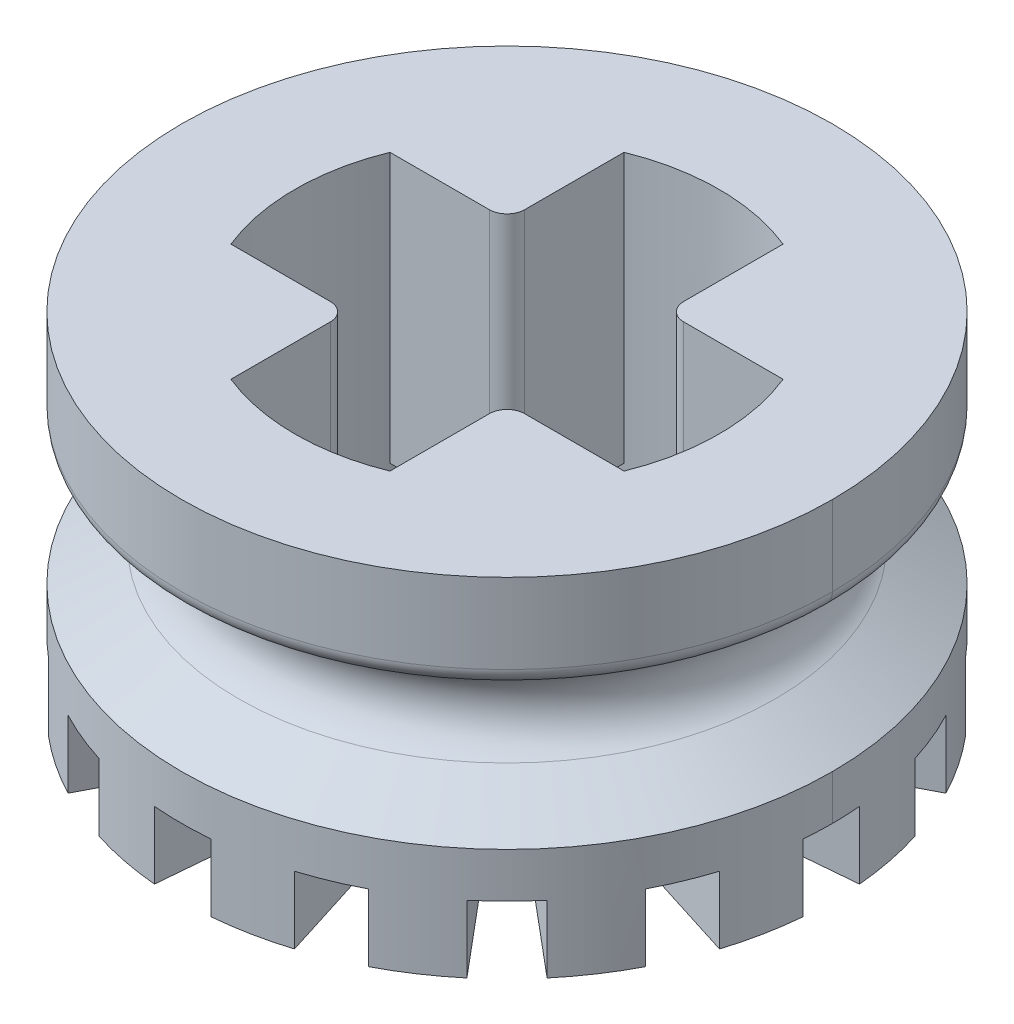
ISO-10303-21;
HEADER;
FILE_DESCRIPTION(('STEP AP214'),'2;1');
FILE_NAME('part.step','',(''),(''),'','','');
FILE_SCHEMA(('AUTOMOTIVE_DESIGN { 1 0 10303 214 1 1 1 1 }'));
ENDSEC;
DATA;
#1=APPLICATION_CONTEXT('core data for automotive mechanical design processes');
#2=APPLICATION_PROTOCOL_DEFINITION('international standard','automotive_design',2000,#1);
#3=PRODUCT_CONTEXT('',#1,'mechanical');
#4=PRODUCT('Part','Part','',(#3));
#5=PRODUCT_RELATED_PRODUCT_CATEGORY('part','',(#4));
#6=PRODUCT_DEFINITION_FORMATION('','',#4);
#7=PRODUCT_DEFINITION_CONTEXT('part definition',#1,'design');
#8=PRODUCT_DEFINITION('design','',#6,#7);
#9=PRODUCT_DEFINITION_SHAPE('','',#8);
#10=(LENGTH_UNIT() NAMED_UNIT(*) SI_UNIT(.MILLI.,.METRE.));
#11=(NAMED_UNIT(*) PLANE_ANGLE_UNIT() SI_UNIT($,.RADIAN.));
#12=(NAMED_UNIT(*) SI_UNIT($,.STERADIAN.) SOLID_ANGLE_UNIT());
#13=UNCERTAINTY_MEASURE_WITH_UNIT(LENGTH_MEASURE(1.E-05),#10,'distance_accuracy_value','');
#14=(GEOMETRIC_REPRESENTATION_CONTEXT(3) GLOBAL_UNCERTAINTY_ASSIGNED_CONTEXT((#13)) GLOBAL_UNIT_ASSIGNED_CONTEXT((#10,
#11,#12)) REPRESENTATION_CONTEXT('',''));
#15=CARTESIAN_POINT('',(0.,0.,0.));
#16=DIRECTION('',(0.,0.,1.));
#17=DIRECTION('',(1.,0.,0.));
#18=AXIS2_PLACEMENT_3D('',#15,#16,#17);
#19=CARTESIAN_POINT('',(0.,0.761999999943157,0.));
#20=DIRECTION('',(0.,-1.,0.));
#21=DIRECTION('',(0.923879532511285,0.,0.382683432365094));
#22=AXIS2_PLACEMENT_3D('',#19,#20,#21);
#23=PLANE('',#22);
#24=CARTESIAN_POINT('',(0.,0.761999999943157,0.));
#25=DIRECTION('',(0.,-1.,0.));
#26=DIRECTION('',(0.,0.,-1.));
#27=AXIS2_PLACEMENT_3D('',#24,#25,#26);
#28=CIRCLE('',#27,2.4);
#29=CARTESIAN_POINT('',(1.10819667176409,0.761999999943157,-2.12882599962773));
#30=VERTEX_POINT('',#29);
#31=CARTESIAN_POINT('',(0.721693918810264,0.761999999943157,-2.28892068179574));
#32=VERTEX_POINT('',#31);
#33=EDGE_CURVE('E779',#30,#32,#28,.F.);
#34=ORIENTED_EDGE('',*,*,#33,.T.);
#35=DIRECTION('',(0.300705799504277,0.,-0.953716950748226));
#36=VECTOR('',#35,1.);
#37=CARTESIAN_POINT('',(0.717965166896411,0.761999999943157,-2.27709459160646));
#38=LINE('',#37,#36);
#39=CARTESIAN_POINT('',(1.10749945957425,0.761999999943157,-3.51253952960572));
#40=VERTEX_POINT('',#39);
#41=EDGE_CURVE('E988',#32,#40,#38,.T.);
#42=ORIENTED_EDGE('',*,*,#41,.T.);
#43=CARTESIAN_POINT('',(0.,0.761999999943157,0.));
#44=DIRECTION('',(0.,-1.,0.));
#45=DIRECTION('',(0.923879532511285,0.,0.382683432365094));
#46=AXIS2_PLACEMENT_3D('',#43,#44,#45);
#47=CIRCLE('',#46,3.683);
#48=CARTESIAN_POINT('',(1.70062014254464,0.761999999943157,-3.26686089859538));
#49=VERTEX_POINT('',#48);
#50=EDGE_CURVE('E985',#40,#49,#47,.T.);
#51=ORIENTED_EDGE('',*,*,#50,.T.);
#52=DIRECTION('',(0.461748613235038,0.,-0.887010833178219));
#53=VECTOR('',#52,1.);
#54=CARTESIAN_POINT('',(1.10247098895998,0.761999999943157,-2.11782706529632));
#55=LINE('',#54,#53);
#56=EDGE_CURVE('E983',#30,#49,#55,.T.);
#57=ORIENTED_EDGE('',*,*,#56,.F.);
#58=EDGE_LOOP('',(#34,#42,#51,#57));
#59=FACE_BOUND('',#58,.T.);
#60=ADVANCED_FACE('F39',(#59),#23,.T.);
#61=CARTESIAN_POINT('',(1.83850666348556,0.761999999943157,-1.54269026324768));
#62=VERTEX_POINT('',#61);
#63=CARTESIAN_POINT('',(1.5426902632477,0.761999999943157,-1.83850666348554));
#64=VERTEX_POINT('',#63);
#65=EDGE_CURVE('E784',#62,#64,#28,.F.);
#66=ORIENTED_EDGE('',*,*,#65,.T.);
#67=DIRECTION('',(0.642787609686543,0.,-0.766044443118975));
#68=VECTOR('',#67,1.);
#69=CARTESIAN_POINT('',(1.53471969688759,0.761999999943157,-1.82900771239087));
#70=LINE('',#69,#68);
#71=CARTESIAN_POINT('',(2.36738676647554,0.761999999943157,-2.82134168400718));
#72=VERTEX_POINT('',#71);
#73=EDGE_CURVE('E971',#64,#72,#70,.T.);
#74=ORIENTED_EDGE('',*,*,#73,.T.);
#75=CARTESIAN_POINT('',(0.,0.761999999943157,0.));
#76=DIRECTION('',(0.,-1.,0.));
#77=DIRECTION('',(0.707106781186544,0.,0.707106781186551));
#78=AXIS2_PLACEMENT_3D('',#75,#76,#77);
#79=CIRCLE('',#78,3.683);
#80=CARTESIAN_POINT('',(2.82134168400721,0.761999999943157,-2.36738676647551));
#81=VERTEX_POINT('',#80);
#82=EDGE_CURVE('E968',#72,#81,#79,.T.);
#83=ORIENTED_EDGE('',*,*,#82,.T.);
#84=DIRECTION('',(0.766044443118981,0.,-0.642787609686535));
#85=VECTOR('',#84,1.);
#86=CARTESIAN_POINT('',(1.82900771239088,0.761999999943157,-1.53471969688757));
#87=LINE('',#86,#85);
#88=EDGE_CURVE('E966',#62,#81,#87,.T.);
#89=ORIENTED_EDGE('',*,*,#88,.F.);
#90=EDGE_LOOP('',(#66,#74,#83,#89));
#91=FACE_BOUND('',#90,.T.);
#92=ADVANCED_FACE('F1172',(#91),#23,.T.);
#93=CARTESIAN_POINT('',(0.,0.761999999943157,0.));
#94=DIRECTION('',(0.,-1.,0.));
#95=DIRECTION('',(-0.923879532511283,0.,-0.3826834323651));
#96=AXIS2_PLACEMENT_3D('',#93,#94,#95);
#97=PLANE('',#96);
#98=CARTESIAN_POINT('',(0.,0.761999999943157,0.));
#99=DIRECTION('',(0.,-1.,0.));
#100=DIRECTION('',(0.,0.,-1.));
#101=AXIS2_PLACEMENT_3D('',#98,#99,#100);
#102=CIRCLE('',#101,2.4);
#103=CARTESIAN_POINT('',(-1.10819667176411,0.761999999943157,2.12882599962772));
#104=VERTEX_POINT('',#103);
#105=CARTESIAN_POINT('',(-0.721693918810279,0.761999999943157,2.28892068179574));
#106=VERTEX_POINT('',#105);
#107=EDGE_CURVE('E662',#104,#106,#102,.F.);
#108=ORIENTED_EDGE('',*,*,#107,.T.);
#109=DIRECTION('',(-0.300705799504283,0.,0.953716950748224));
#110=VECTOR('',#109,1.);
#111=CARTESIAN_POINT('',(-0.717965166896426,0.761999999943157,2.27709459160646));
#112=LINE('',#111,#110);
#113=CARTESIAN_POINT('',(-1.10749945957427,0.761999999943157,3.51253952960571));
#114=VERTEX_POINT('',#113);
#115=EDGE_CURVE('E853',#106,#114,#112,.T.);
#116=ORIENTED_EDGE('',*,*,#115,.T.);
#117=CARTESIAN_POINT('',(0.,0.761999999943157,0.));
#118=DIRECTION('',(0.,-1.,0.));
#119=DIRECTION('',(-0.923879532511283,0.,-0.3826834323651));
#120=AXIS2_PLACEMENT_3D('',#117,#118,#119);
#121=CIRCLE('',#120,3.683);
#122=CARTESIAN_POINT('',(-1.70062014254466,0.761999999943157,3.26686089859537));
#123=VERTEX_POINT('',#122);
#124=EDGE_CURVE('E850',#114,#123,#121,.T.);
#125=ORIENTED_EDGE('',*,*,#124,.T.);
#126=DIRECTION('',(-0.461748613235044,0.,0.887010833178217));
#127=VECTOR('',#126,1.);
#128=CARTESIAN_POINT('',(-1.10247098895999,0.761999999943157,2.11782706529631));
#129=LINE('',#128,#127);
#130=EDGE_CURVE('E848',#104,#123,#129,.T.);
#131=ORIENTED_EDGE('',*,*,#130,.F.);
#132=EDGE_LOOP('',(#108,#116,#125,#131));
#133=FACE_BOUND('',#132,.T.);
#134=ADVANCED_FACE('F1179',(#133),#97,.T.);
#135=CARTESIAN_POINT('',(-1.83850666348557,0.761999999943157,1.54269026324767));
#136=VERTEX_POINT('',#135);
#137=CARTESIAN_POINT('',(-1.54269026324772,0.761999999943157,1.83850666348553));
#138=VERTEX_POINT('',#137);
#139=EDGE_CURVE('E663',#136,#138,#102,.F.);
#140=ORIENTED_EDGE('',*,*,#139,.T.);
#141=DIRECTION('',(-0.642787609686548,0.,0.76604444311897));
#142=VECTOR('',#141,1.);
#143=CARTESIAN_POINT('',(-1.5347196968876,0.761999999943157,1.82900771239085));
#144=LINE('',#143,#142);
#145=CARTESIAN_POINT('',(-2.36738676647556,0.761999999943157,2.82134168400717));
#146=VERTEX_POINT('',#145);
#147=EDGE_CURVE('E836',#138,#146,#144,.T.);
#148=ORIENTED_EDGE('',*,*,#147,.T.);
#149=CARTESIAN_POINT('',(0.,0.761999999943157,0.));
#150=DIRECTION('',(0.,-1.,0.));
#151=DIRECTION('',(-0.707106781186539,0.,-0.707106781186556));
#152=AXIS2_PLACEMENT_3D('',#149,#150,#151);
#153=CIRCLE('',#152,3.683);
#154=CARTESIAN_POINT('',(-2.82134168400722,0.761999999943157,2.36738676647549));
#155=VERTEX_POINT('',#154);
#156=EDGE_CURVE('E833',#146,#155,#153,.T.);
#157=ORIENTED_EDGE('',*,*,#156,.T.);
#158=DIRECTION('',(-0.766044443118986,0.,0.64278760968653));
#159=VECTOR('',#158,1.);
#160=CARTESIAN_POINT('',(-1.82900771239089,0.761999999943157,1.53471969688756));
#161=LINE('',#160,#159);
#162=EDGE_CURVE('E831',#136,#155,#161,.T.);
#163=ORIENTED_EDGE('',*,*,#162,.F.);
#164=EDGE_LOOP('',(#140,#148,#157,#163));
#165=FACE_BOUND('',#164,.T.);
#166=ADVANCED_FACE('F1448',(#165),#97,.T.);
#167=CARTESIAN_POINT('',(0.,0.,0.));
#168=DIRECTION('',(0.,1.,0.));
#169=DIRECTION('',(0.,0.,1.));
#170=AXIS2_PLACEMENT_3D('',#167,#168,#169);
#171=PLANE('',#170);
#172=DIRECTION('',(-0.996194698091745,0.,0.0871557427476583));
#173=VECTOR('',#172,1.);
#174=CARTESIAN_POINT('',(-2.37851446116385,-5.6843418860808E-11,0.20809305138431));
#175=LINE('',#174,#173);
#176=CARTESIAN_POINT('',(-2.39086727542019,0.,0.209173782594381));
#177=VERTEX_POINT('',#176);
#178=CARTESIAN_POINT('',(-3.6689850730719,-5.6843418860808E-11,0.320994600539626));
#179=VERTEX_POINT('',#178);
#180=EDGE_CURVE('E1066',#177,#179,#175,.T.);
#181=ORIENTED_EDGE('',*,*,#180,.F.);
#182=CARTESIAN_POINT('',(0.,0.,0.));
#183=DIRECTION('',(0.,1.,0.));
#184=DIRECTION('',(0.,0.,1.));
#185=AXIS2_PLACEMENT_3D('',#182,#183,#184);
#186=CIRCLE('',#185,2.4);
#187=CARTESIAN_POINT('',(-2.28892068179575,-5.6843418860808E-11,0.721693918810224));
#188=VERTEX_POINT('',#187);
#189=EDGE_CURVE('E671',#188,#177,#186,.F.);
#190=ORIENTED_EDGE('',*,*,#189,.F.);
#191=DIRECTION('',(-0.953716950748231,0.,0.30070579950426));
#192=VECTOR('',#191,1.);
#193=CARTESIAN_POINT('',(-2.27709459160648,-5.6843418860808E-11,0.717965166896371));
#194=LINE('',#193,#192);
#195=CARTESIAN_POINT('',(-3.51253952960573,-5.6843418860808E-11,1.10749945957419));
#196=VERTEX_POINT('',#195);
#197=EDGE_CURVE('E809',#188,#196,#194,.T.);
#198=ORIENTED_EDGE('',*,*,#197,.T.);
#199=CARTESIAN_POINT('',(0.,0.,0.));
#200=DIRECTION('',(0.,1.,0.));
#201=DIRECTION('',(0.,0.,1.));
#202=AXIS2_PLACEMENT_3D('',#199,#200,#201);
#203=CIRCLE('',#202,3.683);
#204=EDGE_CURVE('E1092',#179,#196,#203,.T.);
#205=ORIENTED_EDGE('',*,*,#204,.F.);
#206=EDGE_LOOP('',(#181,#190,#198,#205));
#207=FACE_BOUND('',#206,.T.);
#208=ADVANCED_FACE('F1336',(#207),#171,.F.);
#209=CARTESIAN_POINT('',(0.,3.937,0.));
#210=DIRECTION('',(0.,-1.,0.));
#211=DIRECTION('',(0.,0.,-1.));
#212=AXIS2_PLACEMENT_3D('',#209,#210,#211);
#213=CYLINDRICAL_SURFACE('',#212,3.683);
#214=DIRECTION('',(0.,-1.,0.));
#215=VECTOR('',#214,1.);
#216=CARTESIAN_POINT('',(-3.51253952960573,0.761999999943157,1.10749945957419));
#217=LINE('',#216,#215);
#218=CARTESIAN_POINT('',(-3.51253952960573,0.761999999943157,1.10749945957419));
#219=VERTEX_POINT('',#218);
#220=EDGE_CURVE('E824',#219,#196,#217,.T.);
#221=ORIENTED_EDGE('',*,*,#220,.F.);
#222=CARTESIAN_POINT('',(0.,0.761999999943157,0.));
#223=DIRECTION('',(0.,-1.,0.));
#224=DIRECTION('',(-0.382683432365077,0.,-0.923879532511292));
#225=AXIS2_PLACEMENT_3D('',#222,#223,#224);
#226=CIRCLE('',#225,3.683);
#227=CARTESIAN_POINT('',(-3.26686089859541,0.761999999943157,1.70062014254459));
#228=VERTEX_POINT('',#227);
#229=EDGE_CURVE('E816',#228,#219,#226,.T.);
#230=ORIENTED_EDGE('',*,*,#229,.F.);
#231=DIRECTION('',(0.,-1.,0.));
#232=VECTOR('',#231,1.);
#233=CARTESIAN_POINT('',(-3.26686089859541,0.761999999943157,1.70062014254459));
#234=LINE('',#233,#232);
#235=CARTESIAN_POINT('',(-3.26686089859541,-5.6843418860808E-11,1.70062014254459));
#236=VERTEX_POINT('',#235);
#237=EDGE_CURVE('E821',#228,#236,#234,.T.);
#238=ORIENTED_EDGE('',*,*,#237,.T.);
#239=CARTESIAN_POINT('',(-2.82134168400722,-5.6843418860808E-11,2.36738676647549));
#240=VERTEX_POINT('',#239);
#241=EDGE_CURVE('E1096',#236,#240,#203,.T.);
#242=ORIENTED_EDGE('',*,*,#241,.T.);
#243=DIRECTION('',(0.,-1.,0.));
#244=VECTOR('',#243,1.);
#245=CARTESIAN_POINT('',(-2.82134168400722,0.761999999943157,2.36738676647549));
#246=LINE('',#245,#244);
#247=EDGE_CURVE('E841',#155,#240,#246,.T.);
#248=ORIENTED_EDGE('',*,*,#247,.F.);
#249=ORIENTED_EDGE('',*,*,#156,.F.);
#250=DIRECTION('',(0.,-1.,0.));
#251=VECTOR('',#250,1.);
#252=CARTESIAN_POINT('',(-2.36738676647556,0.761999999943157,2.82134168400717));
#253=LINE('',#252,#251);
#254=CARTESIAN_POINT('',(-2.36738676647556,-5.6843418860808E-11,2.82134168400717));
#255=VERTEX_POINT('',#254);
#256=EDGE_CURVE('E838',#146,#255,#253,.T.);
#257=ORIENTED_EDGE('',*,*,#256,.T.);
#258=CARTESIAN_POINT('',(-1.70062014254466,-5.6843418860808E-11,3.26686089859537));
#259=VERTEX_POINT('',#258);
#260=EDGE_CURVE('E1569',#255,#259,#203,.T.);
#261=ORIENTED_EDGE('',*,*,#260,.T.);
#262=DIRECTION('',(0.,-1.,0.));
#263=VECTOR('',#262,1.);
#264=CARTESIAN_POINT('',(-1.70062014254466,0.761999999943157,3.26686089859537));
#265=LINE('',#264,#263);
#266=EDGE_CURVE('E858',#123,#259,#265,.T.);
#267=ORIENTED_EDGE('',*,*,#266,.F.);
#268=ORIENTED_EDGE('',*,*,#124,.F.);
#269=DIRECTION('',(0.,-1.,0.));
#270=VECTOR('',#269,1.);
#271=CARTESIAN_POINT('',(-1.10749945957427,0.761999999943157,3.51253952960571));
#272=LINE('',#271,#270);
#273=CARTESIAN_POINT('',(-1.10749945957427,-5.6843418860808E-11,3.51253952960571));
#274=VERTEX_POINT('',#273);
#275=EDGE_CURVE('E855',#114,#274,#272,.T.);
#276=ORIENTED_EDGE('',*,*,#275,.T.);
#277=CARTESIAN_POINT('',(-0.320994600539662,-5.6843418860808E-11,3.6689850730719));
#278=VERTEX_POINT('',#277);
#279=EDGE_CURVE('E1567',#274,#278,#203,.T.);
#280=ORIENTED_EDGE('',*,*,#279,.T.);
#281=DIRECTION('',(0.,-1.,0.));
#282=VECTOR('',#281,1.);
#283=CARTESIAN_POINT('',(-0.320994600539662,0.761999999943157,3.6689850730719));
#284=LINE('',#283,#282);
#285=CARTESIAN_POINT('',(-0.320994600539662,0.761999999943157,3.6689850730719));
#286=VERTEX_POINT('',#285);
#287=EDGE_CURVE('E875',#286,#278,#284,.T.);
#288=ORIENTED_EDGE('',*,*,#287,.F.);
#289=CARTESIAN_POINT('',(0.,0.761999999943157,0.));
#290=DIRECTION('',(0.,-1.,0.));
#291=DIRECTION('',(-1.,0.,0.));
#292=AXIS2_PLACEMENT_3D('',#289,#290,#291);
#293=CIRCLE('',#292,3.683);
#294=CARTESIAN_POINT('',(0.320994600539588,0.761999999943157,3.6689850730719));
#295=VERTEX_POINT('',#294);
#296=EDGE_CURVE('E867',#295,#286,#293,.T.);
#297=ORIENTED_EDGE('',*,*,#296,.F.);
#298=DIRECTION('',(0.,-1.,0.));
#299=VECTOR('',#298,1.);
#300=CARTESIAN_POINT('',(0.320994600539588,0.761999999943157,3.6689850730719));
#301=LINE('',#300,#299);
#302=CARTESIAN_POINT('',(0.320994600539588,-5.6843418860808E-11,3.6689850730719));
#303=VERTEX_POINT('',#302);
#304=EDGE_CURVE('E872',#295,#303,#301,.T.);
#305=ORIENTED_EDGE('',*,*,#304,.T.);
#306=CARTESIAN_POINT('',(1.1074994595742,-5.6843418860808E-11,3.51253952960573));
#307=VERTEX_POINT('',#306);
#308=EDGE_CURVE('E1270',#303,#307,#203,.T.);
#309=ORIENTED_EDGE('',*,*,#308,.T.);
#310=DIRECTION('',(0.,-1.,0.));
#311=VECTOR('',#310,1.);
#312=CARTESIAN_POINT('',(1.1074994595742,0.761999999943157,3.51253952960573));
#313=LINE('',#312,#311);
#314=CARTESIAN_POINT('',(1.1074994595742,0.761999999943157,3.51253952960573));
#315=VERTEX_POINT('',#314);
#316=EDGE_CURVE('E892',#315,#307,#313,.T.);
#317=ORIENTED_EDGE('',*,*,#316,.F.);
#318=CARTESIAN_POINT('',(0.,0.761999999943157,0.));
#319=DIRECTION('',(0.,-1.,0.));
#320=DIRECTION('',(-0.923879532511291,0.,0.382683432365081));
#321=AXIS2_PLACEMENT_3D('',#318,#319,#320);
#322=CIRCLE('',#321,3.683);
#323=CARTESIAN_POINT('',(1.7006201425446,0.761999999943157,3.26686089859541));
#324=VERTEX_POINT('',#323);
#325=EDGE_CURVE('E884',#324,#315,#322,.T.);
#326=ORIENTED_EDGE('',*,*,#325,.F.);
#327=DIRECTION('',(0.,-1.,0.));
#328=VECTOR('',#327,1.);
#329=CARTESIAN_POINT('',(1.7006201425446,0.761999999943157,3.26686089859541));
#330=LINE('',#329,#328);
#331=CARTESIAN_POINT('',(1.7006201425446,-5.6843418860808E-11,3.26686089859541));
#332=VERTEX_POINT('',#331);
#333=EDGE_CURVE('E889',#324,#332,#330,.T.);
#334=ORIENTED_EDGE('',*,*,#333,.T.);
#335=CARTESIAN_POINT('',(2.3673867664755,-5.6843418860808E-11,2.82134168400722));
#336=VERTEX_POINT('',#335);
#337=EDGE_CURVE('E1268',#332,#336,#203,.T.);
#338=ORIENTED_EDGE('',*,*,#337,.T.);
#339=DIRECTION('',(0.,-1.,0.));
#340=VECTOR('',#339,1.);
#341=CARTESIAN_POINT('',(2.3673867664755,0.761999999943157,2.82134168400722));
#342=LINE('',#341,#340);
#343=CARTESIAN_POINT('',(2.3673867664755,0.761999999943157,2.82134168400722));
#344=VERTEX_POINT('',#343);
#345=EDGE_CURVE('E909',#344,#336,#342,.T.);
#346=ORIENTED_EDGE('',*,*,#345,.F.);
#347=CARTESIAN_POINT('',(0.,0.761999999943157,0.));
#348=DIRECTION('',(0.,-1.,0.));
#349=DIRECTION('',(-0.707106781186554,0.,0.707106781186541));
#350=AXIS2_PLACEMENT_3D('',#347,#348,#349);
#351=CIRCLE('',#350,3.683);
#352=CARTESIAN_POINT('',(2.82134168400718,0.761999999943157,2.36738676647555));
#353=VERTEX_POINT('',#352);
#354=EDGE_CURVE('E901',#353,#344,#351,.T.);
#355=ORIENTED_EDGE('',*,*,#354,.F.);
#356=DIRECTION('',(0.,-1.,0.));
#357=VECTOR('',#356,1.);
#358=CARTESIAN_POINT('',(2.82134168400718,0.761999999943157,2.36738676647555));
#359=LINE('',#358,#357);
#360=CARTESIAN_POINT('',(2.82134168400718,-5.6843418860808E-11,2.36738676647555));
#361=VERTEX_POINT('',#360);
#362=EDGE_CURVE('E906',#353,#361,#359,.T.);
#363=ORIENTED_EDGE('',*,*,#362,.T.);
#364=CARTESIAN_POINT('',(3.26686089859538,-5.6843418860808E-11,1.70062014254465));
#365=VERTEX_POINT('',#364);
#366=EDGE_CURVE('E1265',#361,#365,#203,.T.);
#367=ORIENTED_EDGE('',*,*,#366,.T.);
#368=DIRECTION('',(0.,-1.,0.));
#369=VECTOR('',#368,1.);
#370=CARTESIAN_POINT('',(3.26686089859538,0.761999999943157,1.70062014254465));
#371=LINE('',#370,#369);
#372=CARTESIAN_POINT('',(3.26686089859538,0.761999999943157,1.70062014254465));
#373=VERTEX_POINT('',#372);
#374=EDGE_CURVE('E926',#373,#365,#371,.T.);
#375=ORIENTED_EDGE('',*,*,#374,.F.);
#376=CARTESIAN_POINT('',(0.,0.761999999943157,0.));
#377=DIRECTION('',(0.,-1.,0.));
#378=DIRECTION('',(-0.382683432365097,0.,0.923879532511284));
#379=AXIS2_PLACEMENT_3D('',#376,#377,#378);
#380=CIRCLE('',#379,3.683);
#381=CARTESIAN_POINT('',(3.51253952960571,0.761999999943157,1.10749945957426));
#382=VERTEX_POINT('',#381);
#383=EDGE_CURVE('E918',#382,#373,#380,.T.);
#384=ORIENTED_EDGE('',*,*,#383,.F.);
#385=DIRECTION('',(0.,-1.,0.));
#386=VECTOR('',#385,1.);
#387=CARTESIAN_POINT('',(3.51253952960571,0.761999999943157,1.10749945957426));
#388=LINE('',#387,#386);
#389=CARTESIAN_POINT('',(3.51253952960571,-5.6843418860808E-11,1.10749945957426));
#390=VERTEX_POINT('',#389);
#391=EDGE_CURVE('E923',#382,#390,#388,.T.);
#392=ORIENTED_EDGE('',*,*,#391,.T.);
#393=CARTESIAN_POINT('',(3.6689850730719,-5.6843418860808E-11,0.32099460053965));
#394=VERTEX_POINT('',#393);
#395=EDGE_CURVE('E1238',#390,#394,#203,.T.);
#396=ORIENTED_EDGE('',*,*,#395,.T.);
#397=DIRECTION('',(0.,-1.,0.));
#398=VECTOR('',#397,1.);
#399=CARTESIAN_POINT('',(3.6689850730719,0.761999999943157,0.32099460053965));
#400=LINE('',#399,#398);
#401=CARTESIAN_POINT('',(3.6689850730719,0.761999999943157,0.32099460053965));
#402=VERTEX_POINT('',#401);
#403=EDGE_CURVE('E942',#402,#394,#400,.T.);
#404=ORIENTED_EDGE('',*,*,#403,.F.);
#405=CARTESIAN_POINT('',(0.,0.761999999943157,0.));
#406=DIRECTION('',(0.,-1.,0.));
#407=DIRECTION('',(0.,0.,-1.));
#408=AXIS2_PLACEMENT_3D('',#405,#406,#407);
#409=CIRCLE('',#408,3.683);
#410=CARTESIAN_POINT('',(3.683,0.761999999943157,0.));
#411=VERTEX_POINT('',#410);
#412=EDGE_CURVE('E1109',#411,#402,#409,.T.);
#413=ORIENTED_EDGE('',*,*,#412,.F.);
#414=DIRECTION('',(0.,-1.,0.));
#415=VECTOR('',#414,1.);
#416=CARTESIAN_POINT('',(3.683,3.937,0.));
#417=LINE('',#416,#415);
#418=CARTESIAN_POINT('',(3.683,1.27,0.));
#419=VERTEX_POINT('',#418);
#420=EDGE_CURVE('E1104',#419,#411,#417,.T.);
#421=ORIENTED_EDGE('',*,*,#420,.F.);
#422=CARTESIAN_POINT('',(0.,1.27,0.));
#423=DIRECTION('',(0.,-1.,0.));
#424=DIRECTION('',(0.,0.,-1.));
#425=AXIS2_PLACEMENT_3D('',#422,#423,#424);
#426=CIRCLE('',#425,3.683);
#427=CARTESIAN_POINT('',(-3.683,1.27,0.));
#428=VERTEX_POINT('',#427);
#429=EDGE_CURVE('E1082',#419,#428,#426,.T.);
#430=ORIENTED_EDGE('',*,*,#429,.T.);
#431=DIRECTION('',(0.,1.,0.));
#432=VECTOR('',#431,1.);
#433=CARTESIAN_POINT('',(-3.683,3.937,0.));
#434=LINE('',#433,#432);
#435=CARTESIAN_POINT('',(-3.683,0.761999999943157,0.));
#436=VERTEX_POINT('',#435);
#437=EDGE_CURVE('E1101',#436,#428,#434,.T.);
#438=ORIENTED_EDGE('',*,*,#437,.F.);
#439=CARTESIAN_POINT('',(0.,0.761999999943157,0.));
#440=DIRECTION('',(0.,-1.,0.));
#441=DIRECTION('',(0.,0.,-1.));
#442=AXIS2_PLACEMENT_3D('',#439,#440,#441);
#443=CIRCLE('',#442,3.683);
#444=CARTESIAN_POINT('',(-3.6689850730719,0.761999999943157,0.320994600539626));
#445=VERTEX_POINT('',#444);
#446=EDGE_CURVE('E1071',#445,#436,#443,.T.);
#447=ORIENTED_EDGE('',*,*,#446,.F.);
#448=DIRECTION('',(0.,-1.,0.));
#449=VECTOR('',#448,1.);
#450=CARTESIAN_POINT('',(-3.6689850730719,0.761999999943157,0.320994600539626));
#451=LINE('',#450,#449);
#452=EDGE_CURVE('E1075',#445,#179,#451,.T.);
#453=ORIENTED_EDGE('',*,*,#452,.T.);
#454=ORIENTED_EDGE('',*,*,#204,.T.);
#455=EDGE_LOOP('',(#221,#230,#238,#242,#248,#249,#257,#261,#267,#268,#276,#280,#288,#297,#305,
#309,#317,#326,#334,#338,#346,#355,#363,#367,#375,#384,#392,#396,#404,#413,#421,#430,#438,#447,
#453,#454));
#456=FACE_BOUND('',#455,.T.);
#457=ADVANCED_FACE('F1235',(#456),#213,.T.);
#458=DIRECTION('',(-0.887010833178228,0.,0.461748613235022));
#459=VECTOR('',#458,1.);
#460=CARTESIAN_POINT('',(-2.11782706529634,-5.6843418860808E-11,1.10247098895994));
#461=LINE('',#460,#459);
#462=CARTESIAN_POINT('',(-2.12882599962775,-5.6843418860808E-11,1.10819667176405));
#463=VERTEX_POINT('',#462);
#464=EDGE_CURVE('E811',#463,#236,#461,.T.);
#465=ORIENTED_EDGE('',*,*,#464,.F.);
#466=CARTESIAN_POINT('',(0.,0.,0.));
#467=DIRECTION('',(0.,1.,0.));
#468=DIRECTION('',(0.,0.,1.));
#469=AXIS2_PLACEMENT_3D('',#466,#467,#468);
#470=CIRCLE('',#469,2.4);
#471=CARTESIAN_POINT('',(-1.83850666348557,0.,1.54269026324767));
#472=VERTEX_POINT('',#471);
#473=EDGE_CURVE('E661',#472,#463,#470,.F.);
#474=ORIENTED_EDGE('',*,*,#473,.F.);
#475=DIRECTION('',(-0.766044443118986,0.,0.64278760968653));
#476=VECTOR('',#475,1.);
#477=CARTESIAN_POINT('',(-1.82900771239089,-5.6843418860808E-11,1.53471969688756));
#478=LINE('',#477,#476);
#479=EDGE_CURVE('E827',#472,#240,#478,.T.);
#480=ORIENTED_EDGE('',*,*,#479,.T.);
#481=ORIENTED_EDGE('',*,*,#241,.F.);
#482=EDGE_LOOP('',(#465,#474,#480,#481));
#483=FACE_BOUND('',#482,.T.);
#484=ADVANCED_FACE('F1611',(#483),#171,.F.);
#485=DIRECTION('',(-0.642787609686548,0.,0.76604444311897));
#486=VECTOR('',#485,1.);
#487=CARTESIAN_POINT('',(-1.5347196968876,-5.6843418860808E-11,1.82900771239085));
#488=LINE('',#487,#486);
#489=CARTESIAN_POINT('',(-1.54269026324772,-5.6843418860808E-11,1.83850666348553));
#490=VERTEX_POINT('',#489);
#491=EDGE_CURVE('E829',#490,#255,#488,.T.);
#492=ORIENTED_EDGE('',*,*,#491,.F.);
#493=CARTESIAN_POINT('',(0.,0.,0.));
#494=DIRECTION('',(0.,1.,0.));
#495=DIRECTION('',(0.,0.,1.));
#496=AXIS2_PLACEMENT_3D('',#493,#494,#495);
#497=CIRCLE('',#496,2.4);
#498=CARTESIAN_POINT('',(-1.10819667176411,0.,2.12882599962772));
#499=VERTEX_POINT('',#498);
#500=EDGE_CURVE('E677',#499,#490,#497,.F.);
#501=ORIENTED_EDGE('',*,*,#500,.F.);
#502=DIRECTION('',(-0.461748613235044,0.,0.887010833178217));
#503=VECTOR('',#502,1.);
#504=CARTESIAN_POINT('',(-1.10247098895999,-5.6843418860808E-11,2.11782706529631));
#505=LINE('',#504,#503);
#506=EDGE_CURVE('E844',#499,#259,#505,.T.);
#507=ORIENTED_EDGE('',*,*,#506,.T.);
#508=ORIENTED_EDGE('',*,*,#260,.F.);
#509=EDGE_LOOP('',(#492,#501,#507,#508));
#510=FACE_BOUND('',#509,.T.);
#511=ADVANCED_FACE('F1591',(#510),#171,.F.);
#512=DIRECTION('',(-0.300705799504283,0.,0.953716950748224));
#513=VECTOR('',#512,1.);
#514=CARTESIAN_POINT('',(-0.717965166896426,-5.6843418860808E-11,2.27709459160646));
#515=LINE('',#514,#513);
#516=CARTESIAN_POINT('',(-0.721693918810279,-5.6843418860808E-11,2.28892068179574));
#517=VERTEX_POINT('',#516);
#518=EDGE_CURVE('E846',#517,#274,#515,.T.);
#519=ORIENTED_EDGE('',*,*,#518,.F.);
#520=CARTESIAN_POINT('',(0.,0.,0.));
#521=DIRECTION('',(0.,1.,0.));
#522=DIRECTION('',(0.,0.,1.));
#523=AXIS2_PLACEMENT_3D('',#520,#521,#522);
#524=CIRCLE('',#523,2.4);
#525=CARTESIAN_POINT('',(-0.209173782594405,0.,2.39086727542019));
#526=VERTEX_POINT('',#525);
#527=EDGE_CURVE('E694',#526,#517,#524,.F.);
#528=ORIENTED_EDGE('',*,*,#527,.F.);
#529=DIRECTION('',(-0.0871557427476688,0.,0.996194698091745));
#530=VECTOR('',#529,1.);
#531=CARTESIAN_POINT('',(-0.208093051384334,-5.6843418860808E-11,2.37851446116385));
#532=LINE('',#531,#530);
#533=EDGE_CURVE('E861',#526,#278,#532,.T.);
#534=ORIENTED_EDGE('',*,*,#533,.T.);
#535=ORIENTED_EDGE('',*,*,#279,.F.);
#536=EDGE_LOOP('',(#519,#528,#534,#535));
#537=FACE_BOUND('',#536,.T.);
#538=ADVANCED_FACE('F1547',(#537),#171,.F.);
#539=DIRECTION('',(0.0871557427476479,0.,0.996194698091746));
#540=VECTOR('',#539,1.);
#541=CARTESIAN_POINT('',(0.208093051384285,-5.6843418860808E-11,2.37851446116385));
#542=LINE('',#541,#540);
#543=CARTESIAN_POINT('',(0.209173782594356,-5.6843418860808E-11,2.39086727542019));
#544=VERTEX_POINT('',#543);
#545=EDGE_CURVE('E863',#544,#303,#542,.T.);
#546=ORIENTED_EDGE('',*,*,#545,.F.);
#547=CARTESIAN_POINT('',(0.,0.,0.));
#548=DIRECTION('',(0.,1.,0.));
#549=DIRECTION('',(0.,0.,1.));
#550=AXIS2_PLACEMENT_3D('',#547,#548,#549);
#551=CIRCLE('',#550,2.4);
#552=CARTESIAN_POINT('',(0.721693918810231,0.,2.28892068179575));
#553=VERTEX_POINT('',#552);
#554=EDGE_CURVE('E714',#553,#544,#551,.F.);
#555=ORIENTED_EDGE('',*,*,#554,.F.);
#556=DIRECTION('',(0.300705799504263,0.,0.95371695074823));
#557=VECTOR('',#556,1.);
#558=CARTESIAN_POINT('',(0.717965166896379,-5.6843418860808E-11,2.27709459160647));
#559=LINE('',#558,#557);
#560=EDGE_CURVE('E878',#553,#307,#559,.T.);
#561=ORIENTED_EDGE('',*,*,#560,.T.);
#562=ORIENTED_EDGE('',*,*,#308,.F.);
#563=EDGE_LOOP('',(#546,#555,#561,#562));
#564=FACE_BOUND('',#563,.T.);
#565=ADVANCED_FACE('F1542',(#564),#171,.F.);
#566=DIRECTION('',(0.461748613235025,0.,0.887010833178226));
#567=VECTOR('',#566,1.);
#568=CARTESIAN_POINT('',(1.10247098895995,-5.6843418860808E-11,2.11782706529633));
#569=LINE('',#568,#567);
#570=CARTESIAN_POINT('',(1.10819667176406,-5.6843418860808E-11,2.12882599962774));
#571=VERTEX_POINT('',#570);
#572=EDGE_CURVE('E880',#571,#332,#569,.T.);
#573=ORIENTED_EDGE('',*,*,#572,.F.);
#574=CARTESIAN_POINT('',(0.,0.,0.));
#575=DIRECTION('',(0.,1.,0.));
#576=DIRECTION('',(0.,0.,1.));
#577=AXIS2_PLACEMENT_3D('',#574,#575,#576);
#578=CIRCLE('',#577,2.4);
#579=CARTESIAN_POINT('',(1.54269026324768,0.,1.83850666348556));
#580=VERTEX_POINT('',#579);
#581=EDGE_CURVE('E734',#580,#571,#578,.F.);
#582=ORIENTED_EDGE('',*,*,#581,.F.);
#583=DIRECTION('',(0.642787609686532,0.,0.766044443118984));
#584=VECTOR('',#583,1.);
#585=CARTESIAN_POINT('',(1.53471969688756,-5.6843418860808E-11,1.82900771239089));
#586=LINE('',#585,#584);
#587=EDGE_CURVE('E895',#580,#336,#586,.T.);
#588=ORIENTED_EDGE('',*,*,#587,.T.);
#589=ORIENTED_EDGE('',*,*,#337,.F.);
#590=EDGE_LOOP('',(#573,#582,#588,#589));
#591=FACE_BOUND('',#590,.T.);
#592=ADVANCED_FACE('F1538',(#591),#171,.F.);
#593=DIRECTION('',(0.766044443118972,0.,0.642787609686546));
#594=VECTOR('',#593,1.);
#595=CARTESIAN_POINT('',(1.82900771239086,-5.6843418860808E-11,1.5347196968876));
#596=LINE('',#595,#594);
#597=CARTESIAN_POINT('',(1.83850666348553,-5.6843418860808E-11,1.54269026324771));
#598=VERTEX_POINT('',#597);
#599=EDGE_CURVE('E897',#598,#361,#596,.T.);
#600=ORIENTED_EDGE('',*,*,#599,.F.);
#601=CARTESIAN_POINT('',(0.,0.,0.));
#602=DIRECTION('',(0.,1.,0.));
#603=DIRECTION('',(0.,0.,1.));
#604=AXIS2_PLACEMENT_3D('',#601,#602,#603);
#605=CIRCLE('',#604,2.4);
#606=CARTESIAN_POINT('',(2.12882599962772,0.,1.1081966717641));
#607=VERTEX_POINT('',#606);
#608=EDGE_CURVE('E754',#607,#598,#605,.F.);
#609=ORIENTED_EDGE('',*,*,#608,.F.);
#610=DIRECTION('',(0.887010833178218,0.,0.461748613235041));
#611=VECTOR('',#610,1.);
#612=CARTESIAN_POINT('',(2.11782706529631,-5.6843418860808E-11,1.10247098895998));
#613=LINE('',#612,#611);
#614=EDGE_CURVE('E912',#607,#365,#613,.T.);
#615=ORIENTED_EDGE('',*,*,#614,.T.);
#616=ORIENTED_EDGE('',*,*,#366,.F.);
#617=EDGE_LOOP('',(#600,#609,#615,#616));
#618=FACE_BOUND('',#617,.T.);
#619=ADVANCED_FACE('F1264',(#618),#171,.F.);
#620=DIRECTION('',(0.953716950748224,0.,0.30070579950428));
#621=VECTOR('',#620,1.);
#622=CARTESIAN_POINT('',(2.27709459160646,-5.6843418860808E-11,0.717965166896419));
#623=LINE('',#622,#621);
#624=CARTESIAN_POINT('',(2.28892068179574,-5.6843418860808E-11,0.721693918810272));
#625=VERTEX_POINT('',#624);
#626=EDGE_CURVE('E914',#625,#390,#623,.T.);
#627=ORIENTED_EDGE('',*,*,#626,.F.);
#628=CARTESIAN_POINT('',(0.,0.,0.));
#629=DIRECTION('',(0.,1.,0.));
#630=DIRECTION('',(0.,0.,1.));
#631=AXIS2_PLACEMENT_3D('',#628,#629,#630);
#632=CIRCLE('',#631,2.4);
#633=CARTESIAN_POINT('',(2.39086727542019,0.,0.209173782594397));
#634=VERTEX_POINT('',#633);
#635=EDGE_CURVE('E774',#634,#625,#632,.F.);
#636=ORIENTED_EDGE('',*,*,#635,.F.);
#637=DIRECTION('',(0.996194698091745,0.,0.0871557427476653));
#638=VECTOR('',#637,1.);
#639=CARTESIAN_POINT('',(2.37851446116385,-5.6843418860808E-11,0.208093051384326));
#640=LINE('',#639,#638);
#641=EDGE_CURVE('E929',#634,#394,#640,.T.);
#642=ORIENTED_EDGE('',*,*,#641,.T.);
#643=ORIENTED_EDGE('',*,*,#395,.F.);
#644=EDGE_LOOP('',(#627,#636,#642,#643));
#645=FACE_BOUND('',#644,.T.);
#646=ADVANCED_FACE('F1246',(#645),#171,.F.);
#647=CARTESIAN_POINT('',(0.,0.761999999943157,0.));
#648=DIRECTION('',(0.,-1.,0.));
#649=DIRECTION('',(0.,0.,1.));
#650=AXIS2_PLACEMENT_3D('',#647,#648,#649);
#651=CIRCLE('',#650,3.683);
#652=CARTESIAN_POINT('',(3.6689850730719,0.761999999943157,-0.320994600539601));
#653=VERTEX_POINT('',#652);
#654=EDGE_CURVE('E935',#653,#411,#651,.T.);
#655=ORIENTED_EDGE('',*,*,#654,.F.);
#656=DIRECTION('',(0.,-1.,0.));
#657=VECTOR('',#656,1.);
#658=CARTESIAN_POINT('',(3.6689850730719,0.761999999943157,-0.320994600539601));
#659=LINE('',#658,#657);
#660=CARTESIAN_POINT('',(3.6689850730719,-5.6843418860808E-11,-0.320994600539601));
#661=VERTEX_POINT('',#660);
#662=EDGE_CURVE('E939',#653,#661,#659,.T.);
#663=ORIENTED_EDGE('',*,*,#662,.T.);
#664=CARTESIAN_POINT('',(3.51253952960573,-5.6843418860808E-11,-1.10749945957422));
#665=VERTEX_POINT('',#664);
#666=EDGE_CURVE('E1212',#661,#665,#203,.T.);
#667=ORIENTED_EDGE('',*,*,#666,.T.);
#668=DIRECTION('',(0.,-1.,0.));
#669=VECTOR('',#668,1.);
#670=CARTESIAN_POINT('',(3.51253952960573,0.761999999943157,-1.10749945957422));
#671=LINE('',#670,#669);
#672=CARTESIAN_POINT('',(3.51253952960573,0.761999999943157,-1.10749945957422));
#673=VERTEX_POINT('',#672);
#674=EDGE_CURVE('E959',#673,#665,#671,.T.);
#675=ORIENTED_EDGE('',*,*,#674,.F.);
#676=CARTESIAN_POINT('',(0.,0.761999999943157,0.));
#677=DIRECTION('',(0.,-1.,0.));
#678=DIRECTION('',(0.382683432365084,0.,0.923879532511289));
#679=AXIS2_PLACEMENT_3D('',#676,#677,#678);
#680=CIRCLE('',#679,3.683);
#681=CARTESIAN_POINT('',(3.2668608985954,0.761999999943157,-1.70062014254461));
#682=VERTEX_POINT('',#681);
#683=EDGE_CURVE('E951',#682,#673,#680,.T.);
#684=ORIENTED_EDGE('',*,*,#683,.F.);
#685=DIRECTION('',(0.,-1.,0.));
#686=VECTOR('',#685,1.);
#687=CARTESIAN_POINT('',(3.2668608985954,0.761999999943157,-1.70062014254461));
#688=LINE('',#687,#686);
#689=CARTESIAN_POINT('',(3.2668608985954,-5.6843418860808E-11,-1.70062014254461));
#690=VERTEX_POINT('',#689);
#691=EDGE_CURVE('E956',#682,#690,#688,.T.);
#692=ORIENTED_EDGE('',*,*,#691,.T.);
#693=CARTESIAN_POINT('',(2.82134168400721,-5.6843418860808E-11,-2.36738676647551));
#694=VERTEX_POINT('',#693);
#695=EDGE_CURVE('E1271',#690,#694,#203,.T.);
#696=ORIENTED_EDGE('',*,*,#695,.T.);
#697=DIRECTION('',(0.,-1.,0.));
#698=VECTOR('',#697,1.);
#699=CARTESIAN_POINT('',(2.82134168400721,0.761999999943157,-2.36738676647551));
#700=LINE('',#699,#698);
#701=EDGE_CURVE('E976',#81,#694,#700,.T.);
#702=ORIENTED_EDGE('',*,*,#701,.F.);
#703=ORIENTED_EDGE('',*,*,#82,.F.);
#704=DIRECTION('',(0.,-1.,0.));
#705=VECTOR('',#704,1.);
#706=CARTESIAN_POINT('',(2.36738676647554,0.761999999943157,-2.82134168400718));
#707=LINE('',#706,#705);
#708=CARTESIAN_POINT('',(2.36738676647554,-5.6843418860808E-11,-2.82134168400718));
#709=VERTEX_POINT('',#708);
#710=EDGE_CURVE('E973',#72,#709,#707,.T.);
#711=ORIENTED_EDGE('',*,*,#710,.T.);
#712=CARTESIAN_POINT('',(1.70062014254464,-5.6843418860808E-11,-3.26686089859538));
#713=VERTEX_POINT('',#712);
#714=EDGE_CURVE('E1272',#709,#713,#203,.T.);
#715=ORIENTED_EDGE('',*,*,#714,.T.);
#716=DIRECTION('',(0.,-1.,0.));
#717=VECTOR('',#716,1.);
#718=CARTESIAN_POINT('',(1.70062014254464,0.761999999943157,-3.26686089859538));
#719=LINE('',#718,#717);
#720=EDGE_CURVE('E993',#49,#713,#719,.T.);
#721=ORIENTED_EDGE('',*,*,#720,.F.);
#722=ORIENTED_EDGE('',*,*,#50,.F.);
#723=DIRECTION('',(0.,-1.,0.));
#724=VECTOR('',#723,1.);
#725=CARTESIAN_POINT('',(1.10749945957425,0.761999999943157,-3.51253952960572));
#726=LINE('',#725,#724);
#727=CARTESIAN_POINT('',(1.10749945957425,-5.6843418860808E-11,-3.51253952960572));
#728=VERTEX_POINT('',#727);
#729=EDGE_CURVE('E990',#40,#728,#726,.T.);
#730=ORIENTED_EDGE('',*,*,#729,.T.);
#731=CARTESIAN_POINT('',(0.320994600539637,-5.6843418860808E-11,-3.6689850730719));
#732=VERTEX_POINT('',#731);
#733=EDGE_CURVE('E1275',#728,#732,#203,.T.);
#734=ORIENTED_EDGE('',*,*,#733,.T.);
#735=DIRECTION('',(0.,-1.,0.));
#736=VECTOR('',#735,1.);
#737=CARTESIAN_POINT('',(0.320994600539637,0.761999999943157,-3.6689850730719));
#738=LINE('',#737,#736);
#739=CARTESIAN_POINT('',(0.320994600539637,0.761999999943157,-3.6689850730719));
#740=VERTEX_POINT('',#739);
#741=EDGE_CURVE('E1010',#740,#732,#738,.T.);
#742=ORIENTED_EDGE('',*,*,#741,.F.);
#743=CARTESIAN_POINT('',(0.,0.761999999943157,0.));
#744=DIRECTION('',(0.,-1.,0.));
#745=DIRECTION('',(1.,0.,0.));
#746=AXIS2_PLACEMENT_3D('',#743,#744,#745);
#747=CIRCLE('',#746,3.683);
#748=CARTESIAN_POINT('',(-0.320994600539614,0.761999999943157,-3.6689850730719));
#749=VERTEX_POINT('',#748);
#750=EDGE_CURVE('E1002',#749,#740,#747,.T.);
#751=ORIENTED_EDGE('',*,*,#750,.F.);
#752=DIRECTION('',(0.,-1.,0.));
#753=VECTOR('',#752,1.);
#754=CARTESIAN_POINT('',(-0.320994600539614,0.761999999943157,-3.6689850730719));
#755=LINE('',#754,#753);
#756=CARTESIAN_POINT('',(-0.320994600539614,-5.6843418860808E-11,-3.6689850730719));
#757=VERTEX_POINT('',#756);
#758=EDGE_CURVE('E1007',#749,#757,#755,.T.);
#759=ORIENTED_EDGE('',*,*,#758,.T.);
#760=CARTESIAN_POINT('',(-1.10749945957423,-5.6843418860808E-11,-3.51253952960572));
#761=VERTEX_POINT('',#760);
#762=EDGE_CURVE('E1279',#757,#761,#203,.T.);
#763=ORIENTED_EDGE('',*,*,#762,.T.);
#764=DIRECTION('',(0.,-1.,0.));
#765=VECTOR('',#764,1.);
#766=CARTESIAN_POINT('',(-1.10749945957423,0.761999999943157,-3.51253952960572));
#767=LINE('',#766,#765);
#768=CARTESIAN_POINT('',(-1.10749945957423,0.761999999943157,-3.51253952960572));
#769=VERTEX_POINT('',#768);
#770=EDGE_CURVE('E1027',#769,#761,#767,.T.);
#771=ORIENTED_EDGE('',*,*,#770,.F.);
#772=CARTESIAN_POINT('',(0.,0.761999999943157,0.));
#773=DIRECTION('',(0.,-1.,0.));
#774=DIRECTION('',(0.923879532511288,0.,-0.382683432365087));
#775=AXIS2_PLACEMENT_3D('',#772,#773,#774);
#776=CIRCLE('',#775,3.683);
#777=CARTESIAN_POINT('',(-1.70062014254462,0.761999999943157,-3.26686089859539));
#778=VERTEX_POINT('',#777);
#779=EDGE_CURVE('E1019',#778,#769,#776,.T.);
#780=ORIENTED_EDGE('',*,*,#779,.F.);
#781=DIRECTION('',(0.,-1.,0.));
#782=VECTOR('',#781,1.);
#783=CARTESIAN_POINT('',(-1.70062014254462,0.761999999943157,-3.26686089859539));
#784=LINE('',#783,#782);
#785=CARTESIAN_POINT('',(-1.70062014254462,-5.6843418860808E-11,-3.26686089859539));
#786=VERTEX_POINT('',#785);
#787=EDGE_CURVE('E1024',#778,#786,#784,.T.);
#788=ORIENTED_EDGE('',*,*,#787,.T.);
#789=CARTESIAN_POINT('',(-2.36738676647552,-5.6843418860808E-11,-2.8213416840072));
#790=VERTEX_POINT('',#789);
#791=EDGE_CURVE('E1283',#786,#790,#203,.T.);
#792=ORIENTED_EDGE('',*,*,#791,.T.);
#793=DIRECTION('',(0.,-1.,0.));
#794=VECTOR('',#793,1.);
#795=CARTESIAN_POINT('',(-2.36738676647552,0.761999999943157,-2.8213416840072));
#796=LINE('',#795,#794);
#797=CARTESIAN_POINT('',(-2.36738676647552,0.761999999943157,-2.8213416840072));
#798=VERTEX_POINT('',#797);
#799=EDGE_CURVE('E1044',#798,#790,#796,.T.);
#800=ORIENTED_EDGE('',*,*,#799,.F.);
#801=CARTESIAN_POINT('',(0.,0.761999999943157,0.));
#802=DIRECTION('',(0.,-1.,0.));
#803=DIRECTION('',(0.707106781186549,0.,-0.707106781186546));
#804=AXIS2_PLACEMENT_3D('',#801,#802,#803);
#805=CIRCLE('',#804,3.683);
#806=CARTESIAN_POINT('',(-2.82134168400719,0.761999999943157,-2.36738676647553));
#807=VERTEX_POINT('',#806);
#808=EDGE_CURVE('E1036',#807,#798,#805,.T.);
#809=ORIENTED_EDGE('',*,*,#808,.F.);
#810=DIRECTION('',(0.,-1.,0.));
#811=VECTOR('',#810,1.);
#812=CARTESIAN_POINT('',(-2.82134168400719,0.761999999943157,-2.36738676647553));
#813=LINE('',#812,#811);
#814=CARTESIAN_POINT('',(-2.82134168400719,-5.6843418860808E-11,-2.36738676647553));
#815=VERTEX_POINT('',#814);
#816=EDGE_CURVE('E1041',#807,#815,#813,.T.);
#817=ORIENTED_EDGE('',*,*,#816,.T.);
#818=CARTESIAN_POINT('',(-3.26686089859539,-5.6843418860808E-11,-1.70062014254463));
#819=VERTEX_POINT('',#818);
#820=EDGE_CURVE('E1287',#815,#819,#203,.T.);
#821=ORIENTED_EDGE('',*,*,#820,.T.);
#822=DIRECTION('',(0.,-1.,0.));
#823=VECTOR('',#822,1.);
#824=CARTESIAN_POINT('',(-3.26686089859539,0.761999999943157,-1.70062014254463));
#825=LINE('',#824,#823);
#826=CARTESIAN_POINT('',(-3.26686089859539,0.761999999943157,-1.70062014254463));
#827=VERTEX_POINT('',#826);
#828=EDGE_CURVE('E1061',#827,#819,#825,.T.);
#829=ORIENTED_EDGE('',*,*,#828,.F.);
#830=CARTESIAN_POINT('',(0.,0.761999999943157,0.));
#831=DIRECTION('',(0.,-1.,0.));
#832=DIRECTION('',(0.382683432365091,0.,-0.923879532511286));
#833=AXIS2_PLACEMENT_3D('',#830,#831,#832);
#834=CIRCLE('',#833,3.683);
#835=CARTESIAN_POINT('',(-3.51253952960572,0.761999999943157,-1.10749945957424));
#836=VERTEX_POINT('',#835);
#837=EDGE_CURVE('E1053',#836,#827,#834,.T.);
#838=ORIENTED_EDGE('',*,*,#837,.F.);
#839=DIRECTION('',(0.,-1.,0.));
#840=VECTOR('',#839,1.);
#841=CARTESIAN_POINT('',(-3.51253952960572,0.761999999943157,-1.10749945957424));
#842=LINE('',#841,#840);
#843=CARTESIAN_POINT('',(-3.51253952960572,-5.6843418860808E-11,-1.10749945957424));
#844=VERTEX_POINT('',#843);
#845=EDGE_CURVE('E1058',#836,#844,#842,.T.);
#846=ORIENTED_EDGE('',*,*,#845,.T.);
#847=CARTESIAN_POINT('',(-3.6689850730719,-5.6843418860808E-11,-0.320994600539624));
#848=VERTEX_POINT('',#847);
#849=EDGE_CURVE('E1091',#844,#848,#203,.T.);
#850=ORIENTED_EDGE('',*,*,#849,.T.);
#851=DIRECTION('',(0.,-1.,0.));
#852=VECTOR('',#851,1.);
#853=CARTESIAN_POINT('',(-3.6689850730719,0.761999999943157,-0.320994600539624));
#854=LINE('',#853,#852);
#855=CARTESIAN_POINT('',(-3.6689850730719,0.761999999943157,-0.320994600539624));
#856=VERTEX_POINT('',#855);
#857=EDGE_CURVE('E1078',#856,#848,#854,.T.);
#858=ORIENTED_EDGE('',*,*,#857,.F.);
#859=EDGE_CURVE('E1070',#436,#856,#443,.T.);
#860=ORIENTED_EDGE('',*,*,#859,.F.);
#861=ORIENTED_EDGE('',*,*,#437,.T.);
#862=EDGE_CURVE('E1081',#428,#419,#426,.T.);
#863=ORIENTED_EDGE('',*,*,#862,.T.);
#864=ORIENTED_EDGE('',*,*,#420,.T.);
#865=EDGE_LOOP('',(#655,#663,#667,#675,#684,#692,#696,#702,#703,#711,#715,#721,#722,#730,#734,
#742,#751,#759,#763,#771,#780,#788,#792,#800,#809,#817,#821,#829,#838,#846,#850,#858,#860,#861,
#863,#864));
#866=FACE_BOUND('',#865,.T.);
#867=ADVANCED_FACE('F1209',(#866),#213,.T.);
#868=DIRECTION('',(0.996194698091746,0.,-0.0871557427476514));
#869=VECTOR('',#868,1.);
#870=CARTESIAN_POINT('',(2.37851446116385,-5.6843418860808E-11,-0.208093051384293));
#871=LINE('',#870,#869);
#872=CARTESIAN_POINT('',(2.39086727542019,-5.6843418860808E-11,-0.209173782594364));
#873=VERTEX_POINT('',#872);
#874=EDGE_CURVE('E931',#873,#661,#871,.T.);
#875=ORIENTED_EDGE('',*,*,#874,.F.);
#876=CARTESIAN_POINT('',(0.,0.,0.));
#877=DIRECTION('',(0.,1.,0.));
#878=DIRECTION('',(0.,0.,1.));
#879=AXIS2_PLACEMENT_3D('',#876,#877,#878);
#880=CIRCLE('',#879,2.4);
#881=CARTESIAN_POINT('',(2.28892068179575,0.,-0.721693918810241));
#882=VERTEX_POINT('',#881);
#883=EDGE_CURVE('E796',#882,#873,#880,.F.);
#884=ORIENTED_EDGE('',*,*,#883,.F.);
#885=DIRECTION('',(0.953716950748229,0.,-0.300705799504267));
#886=VECTOR('',#885,1.);
#887=CARTESIAN_POINT('',(2.27709459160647,-5.6843418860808E-11,-0.717965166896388));
#888=LINE('',#887,#886);
#889=EDGE_CURVE('E945',#882,#665,#888,.T.);
#890=ORIENTED_EDGE('',*,*,#889,.T.);
#891=ORIENTED_EDGE('',*,*,#666,.F.);
#892=EDGE_LOOP('',(#875,#884,#890,#891));
#893=FACE_BOUND('',#892,.T.);
#894=ADVANCED_FACE('F1220',(#893),#171,.F.);
#895=DIRECTION('',(0.887010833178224,0.,-0.461748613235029));
#896=VECTOR('',#895,1.);
#897=CARTESIAN_POINT('',(2.11782706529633,-5.6843418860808E-11,-1.10247098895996));
#898=LINE('',#897,#896);
#899=CARTESIAN_POINT('',(2.12882599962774,0.,-1.10819667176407));
#900=VERTEX_POINT('',#899);
#901=EDGE_CURVE('E947',#900,#690,#898,.T.);
#902=ORIENTED_EDGE('',*,*,#901,.F.);
#903=CARTESIAN_POINT('',(0.,0.,0.));
#904=DIRECTION('',(0.,1.,0.));
#905=DIRECTION('',(0.,0.,1.));
#906=AXIS2_PLACEMENT_3D('',#903,#904,#905);
#907=CIRCLE('',#906,2.4);
#908=CARTESIAN_POINT('',(1.83850666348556,-5.6843418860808E-11,-1.54269026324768));
#909=VERTEX_POINT('',#908);
#910=EDGE_CURVE('E804',#909,#900,#907,.F.);
#911=ORIENTED_EDGE('',*,*,#910,.F.);
#912=DIRECTION('',(0.766044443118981,0.,-0.642787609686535));
#913=VECTOR('',#912,1.);
#914=CARTESIAN_POINT('',(1.82900771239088,-5.6843418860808E-11,-1.53471969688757));
#915=LINE('',#914,#913);
#916=EDGE_CURVE('E962',#909,#694,#915,.T.);
#917=ORIENTED_EDGE('',*,*,#916,.T.);
#918=ORIENTED_EDGE('',*,*,#695,.F.);
#919=EDGE_LOOP('',(#902,#911,#917,#918));
#920=FACE_BOUND('',#919,.T.);
#921=ADVANCED_FACE('F1522',(#920),#171,.F.);
#922=DIRECTION('',(0.642787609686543,0.,-0.766044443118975));
#923=VECTOR('',#922,1.);
#924=CARTESIAN_POINT('',(1.53471969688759,-5.6843418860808E-11,-1.82900771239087));
#925=LINE('',#924,#923);
#926=CARTESIAN_POINT('',(1.5426902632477,0.,-1.83850666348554));
#927=VERTEX_POINT('',#926);
#928=EDGE_CURVE('E964',#927,#709,#925,.T.);
#929=ORIENTED_EDGE('',*,*,#928,.F.);
#930=CARTESIAN_POINT('',(0.,0.,0.));
#931=DIRECTION('',(0.,1.,0.));
#932=DIRECTION('',(0.,0.,1.));
#933=AXIS2_PLACEMENT_3D('',#930,#931,#932);
#934=CIRCLE('',#933,2.4);
#935=CARTESIAN_POINT('',(1.10819667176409,-5.6843418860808E-11,-2.12882599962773));
#936=VERTEX_POINT('',#935);
#937=EDGE_CURVE('E787',#936,#927,#934,.F.);
#938=ORIENTED_EDGE('',*,*,#937,.F.);
#939=DIRECTION('',(0.461748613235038,0.,-0.887010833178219));
#940=VECTOR('',#939,1.);
#941=CARTESIAN_POINT('',(1.10247098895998,-5.6843418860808E-11,-2.11782706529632));
#942=LINE('',#941,#940);
#943=EDGE_CURVE('E979',#936,#713,#942,.T.);
#944=ORIENTED_EDGE('',*,*,#943,.T.);
#945=ORIENTED_EDGE('',*,*,#714,.F.);
#946=EDGE_LOOP('',(#929,#938,#944,#945));
#947=FACE_BOUND('',#946,.T.);
#948=ADVANCED_FACE('F1524',(#947),#171,.F.);
#949=DIRECTION('',(0.300705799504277,0.,-0.953716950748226));
#950=VECTOR('',#949,1.);
#951=CARTESIAN_POINT('',(0.717965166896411,-5.6843418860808E-11,-2.27709459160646));
#952=LINE('',#951,#950);
#953=CARTESIAN_POINT('',(0.721693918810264,0.,-2.28892068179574));
#954=VERTEX_POINT('',#953);
#955=EDGE_CURVE('E981',#954,#728,#952,.T.);
#956=ORIENTED_EDGE('',*,*,#955,.F.);
#957=CARTESIAN_POINT('',(0.,0.,0.));
#958=DIRECTION('',(0.,1.,0.));
#959=DIRECTION('',(0.,0.,1.));
#960=AXIS2_PLACEMENT_3D('',#957,#958,#959);
#961=CIRCLE('',#960,2.4);
#962=CARTESIAN_POINT('',(0.209173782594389,-5.6843418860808E-11,-2.39086727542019));
#963=VERTEX_POINT('',#962);
#964=EDGE_CURVE('E765',#963,#954,#961,.F.);
#965=ORIENTED_EDGE('',*,*,#964,.F.);
#966=DIRECTION('',(0.0871557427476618,0.,-0.996194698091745));
#967=VECTOR('',#966,1.);
#968=CARTESIAN_POINT('',(0.208093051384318,-5.6843418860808E-11,-2.37851446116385));
#969=LINE('',#968,#967);
#970=EDGE_CURVE('E996',#963,#732,#969,.T.);
#971=ORIENTED_EDGE('',*,*,#970,.T.);
#972=ORIENTED_EDGE('',*,*,#733,.F.);
#973=EDGE_LOOP('',(#956,#965,#971,#972));
#974=FACE_BOUND('',#973,.T.);
#975=ADVANCED_FACE('F1529',(#974),#171,.F.);
#976=DIRECTION('',(-0.0871557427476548,0.,-0.996194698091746));
#977=VECTOR('',#976,1.);
#978=CARTESIAN_POINT('',(-0.208093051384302,-5.6843418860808E-11,-2.37851446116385));
#979=LINE('',#978,#977);
#980=CARTESIAN_POINT('',(-0.209173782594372,0.,-2.39086727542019));
#981=VERTEX_POINT('',#980);
#982=EDGE_CURVE('E998',#981,#757,#979,.T.);
#983=ORIENTED_EDGE('',*,*,#982,.F.);
#984=CARTESIAN_POINT('',(0.,0.,0.));
#985=DIRECTION('',(0.,1.,0.));
#986=DIRECTION('',(0.,0.,1.));
#987=AXIS2_PLACEMENT_3D('',#984,#985,#986);
#988=CIRCLE('',#987,2.4);
#989=CARTESIAN_POINT('',(-0.721693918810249,-5.6843418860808E-11,-2.28892068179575));
#990=VERTEX_POINT('',#989);
#991=EDGE_CURVE('E745',#990,#981,#988,.F.);
#992=ORIENTED_EDGE('',*,*,#991,.F.);
#993=DIRECTION('',(-0.30070579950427,0.,-0.953716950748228));
#994=VECTOR('',#993,1.);
#995=CARTESIAN_POINT('',(-0.717965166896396,-5.6843418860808E-11,-2.27709459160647));
#996=LINE('',#995,#994);
#997=EDGE_CURVE('E1013',#990,#761,#996,.T.);
#998=ORIENTED_EDGE('',*,*,#997,.T.);
#999=ORIENTED_EDGE('',*,*,#762,.F.);
#1000=EDGE_LOOP('',(#983,#992,#998,#999));
#1001=FACE_BOUND('',#1000,.T.);
#1002=ADVANCED_FACE('F1668',(#1001),#171,.F.);
#1003=DIRECTION('',(-0.461748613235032,0.,-0.887010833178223));
#1004=VECTOR('',#1003,1.);
#1005=CARTESIAN_POINT('',(-1.10247098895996,-5.6843418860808E-11,-2.11782706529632));
#1006=LINE('',#1005,#1004);
#1007=CARTESIAN_POINT('',(-1.10819667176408,0.,-2.12882599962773));
#1008=VERTEX_POINT('',#1007);
#1009=EDGE_CURVE('E1015',#1008,#786,#1006,.T.);
#1010=ORIENTED_EDGE('',*,*,#1009,.F.);
#1011=CARTESIAN_POINT('',(0.,0.,0.));
#1012=DIRECTION('',(0.,1.,0.));
#1013=DIRECTION('',(0.,0.,1.));
#1014=AXIS2_PLACEMENT_3D('',#1011,#1012,#1013);
#1015=CIRCLE('',#1014,2.4);
#1016=CARTESIAN_POINT('',(-1.54269026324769,-5.6843418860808E-11,-1.83850666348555));
#1017=VERTEX_POINT('',#1016);
#1018=EDGE_CURVE('E725',#1017,#1008,#1015,.F.);
#1019=ORIENTED_EDGE('',*,*,#1018,.F.);
#1020=DIRECTION('',(-0.642787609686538,0.,-0.766044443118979));
#1021=VECTOR('',#1020,1.);
#1022=CARTESIAN_POINT('',(-1.53471969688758,-5.6843418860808E-11,-1.82900771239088));
#1023=LINE('',#1022,#1021);
#1024=EDGE_CURVE('E1030',#1017,#790,#1023,.T.);
#1025=ORIENTED_EDGE('',*,*,#1024,.T.);
#1026=ORIENTED_EDGE('',*,*,#791,.F.);
#1027=EDGE_LOOP('',(#1010,#1019,#1025,#1026));
#1028=FACE_BOUND('',#1027,.T.);
#1029=ADVANCED_FACE('F1652',(#1028),#171,.F.);
#1030=DIRECTION('',(-0.766044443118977,0.,-0.642787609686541));
#1031=VECTOR('',#1030,1.);
#1032=CARTESIAN_POINT('',(-1.82900771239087,-5.6843418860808E-11,-1.53471969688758));
#1033=LINE('',#1032,#1031);
#1034=CARTESIAN_POINT('',(-1.83850666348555,0.,-1.5426902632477));
#1035=VERTEX_POINT('',#1034);
#1036=EDGE_CURVE('E1032',#1035,#815,#1033,.T.);
#1037=ORIENTED_EDGE('',*,*,#1036,.F.);
#1038=CARTESIAN_POINT('',(0.,0.,0.));
#1039=DIRECTION('',(0.,1.,0.));
#1040=DIRECTION('',(0.,0.,1.));
#1041=AXIS2_PLACEMENT_3D('',#1038,#1039,#1040);
#1042=CIRCLE('',#1041,2.4);
#1043=CARTESIAN_POINT('',(-2.12882599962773,-5.6843418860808E-11,-1.10819667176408));
#1044=VERTEX_POINT('',#1043);
#1045=EDGE_CURVE('E705',#1044,#1035,#1042,.F.);
#1046=ORIENTED_EDGE('',*,*,#1045,.F.);
#1047=DIRECTION('',(-0.887010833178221,0.,-0.461748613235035));
#1048=VECTOR('',#1047,1.);
#1049=CARTESIAN_POINT('',(-2.11782706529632,-5.6843418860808E-11,-1.10247098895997));
#1050=LINE('',#1049,#1048);
#1051=EDGE_CURVE('E1047',#1044,#819,#1050,.T.);
#1052=ORIENTED_EDGE('',*,*,#1051,.T.);
#1053=ORIENTED_EDGE('',*,*,#820,.F.);
#1054=EDGE_LOOP('',(#1037,#1046,#1052,#1053));
#1055=FACE_BOUND('',#1054,.T.);
#1056=ADVANCED_FACE('F1335',(#1055),#171,.F.);
#1057=DIRECTION('',(-0.953716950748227,0.,-0.300705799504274));
#1058=VECTOR('',#1057,1.);
#1059=CARTESIAN_POINT('',(-2.27709459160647,-5.6843418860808E-11,-0.717965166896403));
#1060=LINE('',#1059,#1058);
#1061=CARTESIAN_POINT('',(-2.28892068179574,0.,-0.721693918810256));
#1062=VERTEX_POINT('',#1061);
#1063=EDGE_CURVE('E1049',#1062,#844,#1060,.T.);
#1064=ORIENTED_EDGE('',*,*,#1063,.F.);
#1065=CARTESIAN_POINT('',(0.,0.,0.));
#1066=DIRECTION('',(0.,1.,0.));
#1067=DIRECTION('',(0.,0.,1.));
#1068=AXIS2_PLACEMENT_3D('',#1065,#1066,#1067);
#1069=CIRCLE('',#1068,2.4);
#1070=CARTESIAN_POINT('',(-2.39086727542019,-5.6843418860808E-11,-0.20917378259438));
#1071=VERTEX_POINT('',#1070);
#1072=EDGE_CURVE('E688',#1071,#1062,#1069,.F.);
#1073=ORIENTED_EDGE('',*,*,#1072,.F.);
#1074=DIRECTION('',(-0.996194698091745,0.,-0.0871557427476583));
#1075=VECTOR('',#1074,1.);
#1076=CARTESIAN_POINT('',(-2.37851446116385,-5.6843418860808E-11,-0.208093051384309));
#1077=LINE('',#1076,#1075);
#1078=EDGE_CURVE('E1064',#1071,#848,#1077,.T.);
#1079=ORIENTED_EDGE('',*,*,#1078,.T.);
#1080=ORIENTED_EDGE('',*,*,#849,.F.);
#1081=EDGE_LOOP('',(#1064,#1073,#1079,#1080));
#1082=FACE_BOUND('',#1081,.T.);
#1083=ADVANCED_FACE('F1331',(#1082),#171,.F.);
#1084=CARTESIAN_POINT('',(3.683,3.937,0.));
#1085=VERTEX_POINT('',#1084);
#1086=CARTESIAN_POINT('',(3.683,3.03268637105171,0.));
#1087=VERTEX_POINT('',#1086);
#1088=EDGE_CURVE('E1105',#1085,#1087,#417,.T.);
#1089=ORIENTED_EDGE('',*,*,#1088,.T.);
#1090=CARTESIAN_POINT('',(0.,3.03268637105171,0.));
#1091=DIRECTION('',(0.,1.,0.));
#1092=DIRECTION('',(0.,0.,1.));
#1093=AXIS2_PLACEMENT_3D('',#1090,#1091,#1092);
#1094=CIRCLE('',#1093,3.683);
#1095=CARTESIAN_POINT('',(-3.683,3.03268637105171,0.));
#1096=VERTEX_POINT('',#1095);
#1097=EDGE_CURVE('E1117',#1087,#1096,#1094,.T.);
#1098=ORIENTED_EDGE('',*,*,#1097,.T.);
#1099=CARTESIAN_POINT('',(-3.683,3.937,0.));
#1100=VERTEX_POINT('',#1099);
#1101=EDGE_CURVE('E1100',#1096,#1100,#434,.T.);
#1102=ORIENTED_EDGE('',*,*,#1101,.T.);
#1103=CARTESIAN_POINT('',(0.,3.937,0.));
#1104=DIRECTION('',(0.,1.,0.));
#1105=DIRECTION('',(0.,0.,1.));
#1106=AXIS2_PLACEMENT_3D('',#1103,#1104,#1105);
#1107=CIRCLE('',#1106,3.683);
#1108=EDGE_CURVE('E1095',#1085,#1100,#1107,.T.);
#1109=ORIENTED_EDGE('',*,*,#1108,.F.);
#1110=EDGE_LOOP('',(#1089,#1098,#1102,#1109));
#1111=FACE_BOUND('',#1110,.T.);
#1112=ADVANCED_FACE('F1334',(#1111),#213,.T.);
#1113=ORIENTED_EDGE('',*,*,#1101,.F.);
#1114=CARTESIAN_POINT('',(0.,3.03268637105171,0.));
#1115=DIRECTION('',(0.,1.,0.));
#1116=DIRECTION('',(0.,0.,1.));
#1117=AXIS2_PLACEMENT_3D('',#1114,#1115,#1116);
#1118=CIRCLE('',#1117,3.683);
#1119=EDGE_CURVE('E1120',#1096,#1087,#1118,.T.);
#1120=ORIENTED_EDGE('',*,*,#1119,.T.);
#1121=ORIENTED_EDGE('',*,*,#1088,.F.);
#1122=EDGE_CURVE('E1097',#1100,#1085,#1107,.T.);
#1123=ORIENTED_EDGE('',*,*,#1122,.F.);
#1124=EDGE_LOOP('',(#1113,#1120,#1121,#1123));
#1125=FACE_BOUND('',#1124,.T.);
#1126=ADVANCED_FACE('F1339',(#1125),#213,.T.);
#1127=CARTESIAN_POINT('',(0.,3.937,0.));
#1128=DIRECTION('',(0.,1.,0.));
#1129=DIRECTION('',(0.,0.,1.));
#1130=AXIS2_PLACEMENT_3D('',#1127,#1128,#1129);
#1131=PLANE('',#1130);
#1132=DIRECTION('',(1.,0.,0.));
#1133=VECTOR('',#1132,1.);
#1134=CARTESIAN_POINT('',(-2.2248595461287,3.937,-0.9));
#1135=LINE('',#1134,#1133);
#1136=CARTESIAN_POINT('',(-2.2248595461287,3.937,-0.9));
#1137=VERTEX_POINT('',#1136);
#1138=CARTESIAN_POINT('',(-1.1,3.937,-0.9));
#1139=VERTEX_POINT('',#1138);
#1140=EDGE_CURVE('E643',#1137,#1139,#1135,.T.);
#1141=ORIENTED_EDGE('',*,*,#1140,.T.);
#1142=CARTESIAN_POINT('',(-1.1,3.937,-1.1));
#1143=DIRECTION('',(0.,1.,0.));
#1144=DIRECTION('',(0.,0.,1.));
#1145=AXIS2_PLACEMENT_3D('',#1142,#1143,#1144);
#1146=CIRCLE('',#1145,0.2);
#1147=CARTESIAN_POINT('',(-0.9,3.937,-1.1));
#1148=VERTEX_POINT('',#1147);
#1149=EDGE_CURVE('E1133',#1139,#1148,#1146,.T.);
#1150=ORIENTED_EDGE('',*,*,#1149,.T.);
#1151=DIRECTION('',(0.,0.,-1.));
#1152=VECTOR('',#1151,1.);
#1153=CARTESIAN_POINT('',(-0.9,3.937,-2.2248595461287));
#1154=LINE('',#1153,#1152);
#1155=CARTESIAN_POINT('',(-0.9,3.937,-2.2248595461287));
#1156=VERTEX_POINT('',#1155);
#1157=EDGE_CURVE('E637',#1148,#1156,#1154,.T.);
#1158=ORIENTED_EDGE('',*,*,#1157,.T.);
#1159=CARTESIAN_POINT('',(0.,3.937,0.));
#1160=DIRECTION('',(0.,1.,0.));
#1161=DIRECTION('',(0.,0.,1.));
#1162=AXIS2_PLACEMENT_3D('',#1159,#1160,#1161);
#1163=CIRCLE('',#1162,2.4);
#1164=CARTESIAN_POINT('',(0.9,3.937,-2.2248595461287));
#1165=VERTEX_POINT('',#1164);
#1166=EDGE_CURVE('E579',#1165,#1156,#1163,.T.);
#1167=ORIENTED_EDGE('',*,*,#1166,.F.);
#1168=DIRECTION('',(0.,0.,1.));
#1169=VECTOR('',#1168,1.);
#1170=CARTESIAN_POINT('',(0.9,3.937,-2.2248595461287));
#1171=LINE('',#1170,#1169);
#1172=CARTESIAN_POINT('',(0.9,3.937,-1.1));
#1173=VERTEX_POINT('',#1172);
#1174=EDGE_CURVE('E605',#1165,#1173,#1171,.T.);
#1175=ORIENTED_EDGE('',*,*,#1174,.T.);
#1176=CARTESIAN_POINT('',(1.1,3.937,-1.1));
#1177=DIRECTION('',(0.,1.,0.));
#1178=DIRECTION('',(0.,0.,1.));
#1179=AXIS2_PLACEMENT_3D('',#1176,#1177,#1178);
#1180=CIRCLE('',#1179,0.2);
#1181=CARTESIAN_POINT('',(1.1,3.937,-0.9));
#1182=VERTEX_POINT('',#1181);
#1183=EDGE_CURVE('E1129',#1173,#1182,#1180,.T.);
#1184=ORIENTED_EDGE('',*,*,#1183,.T.);
#1185=DIRECTION('',(1.,0.,0.));
#1186=VECTOR('',#1185,1.);
#1187=CARTESIAN_POINT('',(0.9,3.937,-0.9));
#1188=LINE('',#1187,#1186);
#1189=CARTESIAN_POINT('',(2.2248595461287,3.937,-0.9));
#1190=VERTEX_POINT('',#1189);
#1191=EDGE_CURVE('E610',#1182,#1190,#1188,.T.);
#1192=ORIENTED_EDGE('',*,*,#1191,.T.);
#1193=CARTESIAN_POINT('',(2.2248595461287,3.937,0.9));
#1194=VERTEX_POINT('',#1193);
#1195=EDGE_CURVE('E577',#1194,#1190,#1163,.T.);
#1196=ORIENTED_EDGE('',*,*,#1195,.F.);
#1197=DIRECTION('',(-1.,0.,0.));
#1198=VECTOR('',#1197,1.);
#1199=CARTESIAN_POINT('',(0.9,3.937,0.9));
#1200=LINE('',#1199,#1198);
#1201=CARTESIAN_POINT('',(1.1,3.937,0.9));
#1202=VERTEX_POINT('',#1201);
#1203=EDGE_CURVE('E622',#1194,#1202,#1200,.T.);
#1204=ORIENTED_EDGE('',*,*,#1203,.T.);
#1205=CARTESIAN_POINT('',(1.1,3.937,1.1));
#1206=DIRECTION('',(0.,1.,0.));
#1207=DIRECTION('',(0.,0.,1.));
#1208=AXIS2_PLACEMENT_3D('',#1205,#1206,#1207);
#1209=CIRCLE('',#1208,0.2);
#1210=CARTESIAN_POINT('',(0.9,3.937,1.1));
#1211=VERTEX_POINT('',#1210);
#1212=EDGE_CURVE('E1127',#1202,#1211,#1209,.T.);
#1213=ORIENTED_EDGE('',*,*,#1212,.T.);
#1214=DIRECTION('',(0.,0.,1.));
#1215=VECTOR('',#1214,1.);
#1216=CARTESIAN_POINT('',(0.9,3.937,0.9));
#1217=LINE('',#1216,#1215);
#1218=CARTESIAN_POINT('',(0.9,3.937,2.2248595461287));
#1219=VERTEX_POINT('',#1218);
#1220=EDGE_CURVE('E572',#1211,#1219,#1217,.T.);
#1221=ORIENTED_EDGE('',*,*,#1220,.T.);
#1222=CARTESIAN_POINT('',(-0.899999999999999,3.937,2.2248595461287));
#1223=VERTEX_POINT('',#1222);
#1224=EDGE_CURVE('E565',#1223,#1219,#1163,.T.);
#1225=ORIENTED_EDGE('',*,*,#1224,.F.);
#1226=DIRECTION('',(0.,0.,-1.));
#1227=VECTOR('',#1226,1.);
#1228=CARTESIAN_POINT('',(-0.9,3.937,0.9));
#1229=LINE('',#1228,#1227);
#1230=CARTESIAN_POINT('',(-0.9,3.937,1.1));
#1231=VERTEX_POINT('',#1230);
#1232=EDGE_CURVE('E571',#1223,#1231,#1229,.T.);
#1233=ORIENTED_EDGE('',*,*,#1232,.T.);
#1234=CARTESIAN_POINT('',(-1.1,3.937,1.1));
#1235=DIRECTION('',(0.,1.,0.));
#1236=DIRECTION('',(0.,0.,1.));
#1237=AXIS2_PLACEMENT_3D('',#1234,#1235,#1236);
#1238=CIRCLE('',#1237,0.2);
#1239=CARTESIAN_POINT('',(-1.1,3.937,0.9));
#1240=VERTEX_POINT('',#1239);
#1241=EDGE_CURVE('E1131',#1231,#1240,#1238,.T.);
#1242=ORIENTED_EDGE('',*,*,#1241,.T.);
#1243=DIRECTION('',(-1.,0.,0.));
#1244=VECTOR('',#1243,1.);
#1245=CARTESIAN_POINT('',(-2.2248595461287,3.937,0.9));
#1246=LINE('',#1245,#1244);
#1247=CARTESIAN_POINT('',(-2.2248595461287,3.937,0.9));
#1248=VERTEX_POINT('',#1247);
#1249=EDGE_CURVE('E598',#1240,#1248,#1246,.T.);
#1250=ORIENTED_EDGE('',*,*,#1249,.T.);
#1251=EDGE_CURVE('E576',#1137,#1248,#1163,.T.);
#1252=ORIENTED_EDGE('',*,*,#1251,.F.);
#1253=EDGE_LOOP('',(#1141,#1150,#1158,#1167,#1175,#1184,#1192,#1196,#1204,#1213,#1221,#1225,
#1233,#1242,#1250,#1252));
#1254=FACE_BOUND('',#1253,.T.);
#1255=ORIENTED_EDGE('',*,*,#1122,.T.);
#1256=ORIENTED_EDGE('',*,*,#1108,.T.);
#1257=EDGE_LOOP('',(#1255,#1256));
#1258=FACE_BOUND('',#1257,.T.);
#1259=ADVANCED_FACE('F568',(#1254,#1258),#1131,.T.);
#1260=CARTESIAN_POINT('',(0.,2.921,0.));
#1261=DIRECTION('',(0.,1.,0.));
#1262=DIRECTION('',(0.,0.,1.));
#1263=AXIS2_PLACEMENT_3D('',#1260,#1261,#1262);
#1264=CONICAL_SURFACE('',#1263,3.683,1.02527862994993);
#1265=CARTESIAN_POINT('',(0.,2.86305032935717,0.));
#1266=DIRECTION('',(0.,-1.,0.));
#1267=DIRECTION('',(0.,0.,-1.));
#1268=AXIS2_PLACEMENT_3D('',#1265,#1266,#1267);
#1269=CIRCLE('',#1268,3.58752392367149);
#1270=CARTESIAN_POINT('',(3.58752392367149,2.86305032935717,0.));
#1271=VERTEX_POINT('',#1270);
#1272=CARTESIAN_POINT('',(-3.58752392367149,2.86305032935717,0.));
#1273=VERTEX_POINT('',#1272);
#1274=EDGE_CURVE('E1112',#1271,#1273,#1269,.T.);
#1275=ORIENTED_EDGE('',*,*,#1274,.T.);
#1276=CARTESIAN_POINT('',(0.,2.86305032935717,0.));
#1277=DIRECTION('',(0.,-1.,0.));
#1278=DIRECTION('',(0.,0.,-1.));
#1279=AXIS2_PLACEMENT_3D('',#1276,#1277,#1278);
#1280=CIRCLE('',#1279,3.58752392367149);
#1281=EDGE_CURVE('E1114',#1273,#1271,#1280,.T.);
#1282=ORIENTED_EDGE('',*,*,#1281,.T.);
#1283=EDGE_LOOP('',(#1275,#1282));
#1284=FACE_BOUND('',#1283,.T.);
#1285=CARTESIAN_POINT('',(0.,2.52976826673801,0.));
#1286=DIRECTION('',(0.,-1.,0.));
#1287=DIRECTION('',(0.,0.,-1.));
#1288=AXIS2_PLACEMENT_3D('',#1285,#1286,#1287);
#1289=CIRCLE('',#1288,3.03841875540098);
#1290=CARTESIAN_POINT('',(0.,2.52976826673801,-3.03841875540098));
#1291=VERTEX_POINT('',#1290);
#1292=EDGE_CURVE('E1088',#1291,#1291,#1289,.T.);
#1293=ORIENTED_EDGE('',*,*,#1292,.F.);
#1294=EDGE_LOOP('',(#1293));
#1295=FACE_BOUND('',#1294,.T.);
#1296=ADVANCED_FACE('F1323',(#1284,#1295),#1264,.T.);
#1297=CARTESIAN_POINT('',(0.,2.0955,0.));
#1298=DIRECTION('',(0.,-1.,0.));
#1299=DIRECTION('',(0.,0.,-1.));
#1300=AXIS2_PLACEMENT_3D('',#1297,#1298,#1299);
#1301=TOROIDAL_SURFACE('',#1300,3.302,0.508);
#1302=CARTESIAN_POINT('',(0.,1.66123173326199,0.));
#1303=DIRECTION('',(0.,-1.,0.));
#1304=DIRECTION('',(0.,0.,-1.));
#1305=AXIS2_PLACEMENT_3D('',#1302,#1303,#1304);
#1306=CIRCLE('',#1305,3.03841875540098);
#1307=CARTESIAN_POINT('',(0.,1.66123173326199,-3.03841875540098));
#1308=VERTEX_POINT('',#1307);
#1309=EDGE_CURVE('E1085',#1308,#1308,#1306,.T.);
#1310=ORIENTED_EDGE('',*,*,#1309,.F.);
#1311=EDGE_LOOP('',(#1310));
#1312=FACE_BOUND('',#1311,.T.);
#1313=ORIENTED_EDGE('',*,*,#1292,.T.);
#1314=EDGE_LOOP('',(#1313));
#1315=FACE_BOUND('',#1314,.T.);
#1316=ADVANCED_FACE('F1314',(#1312,#1315),#1301,.F.);
#1317=CARTESIAN_POINT('',(0.,1.27,0.));
#1318=DIRECTION('',(0.,-1.,0.));
#1319=DIRECTION('',(0.,0.,-1.));
#1320=AXIS2_PLACEMENT_3D('',#1317,#1318,#1319);
#1321=CONICAL_SURFACE('',#1320,3.683,1.02527862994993);
#1322=ORIENTED_EDGE('',*,*,#1309,.T.);
#1323=EDGE_LOOP('',(#1322));
#1324=FACE_BOUND('',#1323,.T.);
#1325=ORIENTED_EDGE('',*,*,#429,.F.);
#1326=ORIENTED_EDGE('',*,*,#862,.F.);
#1327=EDGE_LOOP('',(#1325,#1326));
#1328=FACE_BOUND('',#1327,.T.);
#1329=ADVANCED_FACE('F1312',(#1324,#1328),#1321,.T.);
#1330=CARTESIAN_POINT('',(-2.37851446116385,0.761999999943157,-0.208093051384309));
#1331=DIRECTION('',(-0.0871557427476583,0.,0.996194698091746));
#1332=DIRECTION('',(0.996194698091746,0.,0.0871557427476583));
#1333=AXIS2_PLACEMENT_3D('',#1330,#1331,#1332);
#1334=PLANE('',#1333);
#1335=DIRECTION('',(0.,1.,0.));
#1336=VECTOR('',#1335,1.);
#1337=CARTESIAN_POINT('',(-2.39086727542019,-0.00100000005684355,-0.20917378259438));
#1338=LINE('',#1337,#1336);
#1339=CARTESIAN_POINT('',(-2.39086727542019,0.761999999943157,-0.20917378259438));
#1340=VERTEX_POINT('',#1339);
#1341=EDGE_CURVE('E685',#1071,#1340,#1338,.T.);
#1342=ORIENTED_EDGE('',*,*,#1341,.T.);
#1343=DIRECTION('',(-0.996194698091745,0.,-0.0871557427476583));
#1344=VECTOR('',#1343,1.);
#1345=CARTESIAN_POINT('',(-2.37851446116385,0.761999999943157,-0.208093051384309));
#1346=LINE('',#1345,#1344);
#1347=EDGE_CURVE('E1068',#1340,#856,#1346,.T.);
#1348=ORIENTED_EDGE('',*,*,#1347,.T.);
#1349=ORIENTED_EDGE('',*,*,#857,.T.);
#1350=ORIENTED_EDGE('',*,*,#1078,.F.);
#1351=EDGE_LOOP('',(#1342,#1348,#1349,#1350));
#1352=FACE_BOUND('',#1351,.T.);
#1353=ADVANCED_FACE('F1303',(#1352),#1334,.T.);
#1354=CARTESIAN_POINT('',(-2.37851446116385,0.761999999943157,0.20809305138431));
#1355=DIRECTION('',(0.0871557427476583,0.,0.996194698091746));
#1356=DIRECTION('',(0.996194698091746,0.,-0.0871557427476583));
#1357=AXIS2_PLACEMENT_3D('',#1354,#1355,#1356);
#1358=PLANE('',#1357);
#1359=DIRECTION('',(-0.996194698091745,0.,0.0871557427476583));
#1360=VECTOR('',#1359,1.);
#1361=CARTESIAN_POINT('',(-2.37851446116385,0.761999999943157,0.20809305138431));
#1362=LINE('',#1361,#1360);
#1363=CARTESIAN_POINT('',(-2.39086727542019,0.761999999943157,0.209173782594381));
#1364=VERTEX_POINT('',#1363);
#1365=EDGE_CURVE('E1073',#1364,#445,#1362,.T.);
#1366=ORIENTED_EDGE('',*,*,#1365,.F.);
#1367=DIRECTION('',(0.,1.,0.));
#1368=VECTOR('',#1367,1.);
#1369=CARTESIAN_POINT('',(-2.39086727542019,-0.00100000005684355,0.209173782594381));
#1370=LINE('',#1369,#1368);
#1371=EDGE_CURVE('E675',#177,#1364,#1370,.T.);
#1372=ORIENTED_EDGE('',*,*,#1371,.F.);
#1373=ORIENTED_EDGE('',*,*,#180,.T.);
#1374=ORIENTED_EDGE('',*,*,#452,.F.);
#1375=EDGE_LOOP('',(#1366,#1372,#1373,#1374));
#1376=FACE_BOUND('',#1375,.T.);
#1377=ADVANCED_FACE('F1321',(#1376),#1358,.F.);
#1378=CARTESIAN_POINT('',(0.,0.761999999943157,0.));
#1379=DIRECTION('',(0.,-1.,0.));
#1380=DIRECTION('',(0.,0.,-1.));
#1381=AXIS2_PLACEMENT_3D('',#1378,#1379,#1380);
#1382=PLANE('',#1381);
#1383=CARTESIAN_POINT('',(0.,0.761999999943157,0.));
#1384=DIRECTION('',(0.,-1.,0.));
#1385=DIRECTION('',(0.,0.,-1.));
#1386=AXIS2_PLACEMENT_3D('',#1383,#1384,#1385);
#1387=CIRCLE('',#1386,2.4);
#1388=EDGE_CURVE('E682',#1340,#1364,#1387,.F.);
#1389=ORIENTED_EDGE('',*,*,#1388,.T.);
#1390=ORIENTED_EDGE('',*,*,#1365,.T.);
#1391=ORIENTED_EDGE('',*,*,#446,.T.);
#1392=ORIENTED_EDGE('',*,*,#859,.T.);
#1393=ORIENTED_EDGE('',*,*,#1347,.F.);
#1394=EDGE_LOOP('',(#1389,#1390,#1391,#1392,#1393));
#1395=FACE_BOUND('',#1394,.T.);
#1396=ADVANCED_FACE('F1307',(#1395),#1382,.T.);
#1397=CARTESIAN_POINT('',(-2.11782706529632,0.761999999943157,-1.10247098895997));
#1398=DIRECTION('',(-0.461748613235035,0.,0.887010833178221));
#1399=DIRECTION('',(0.887010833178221,0.,0.461748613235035));
#1400=AXIS2_PLACEMENT_3D('',#1397,#1398,#1399);
#1401=PLANE('',#1400);
#1402=DIRECTION('',(0.,1.,0.));
#1403=VECTOR('',#1402,1.);
#1404=CARTESIAN_POINT('',(-2.12882599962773,-0.00100000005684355,-1.10819667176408));
#1405=LINE('',#1404,#1403);
#1406=CARTESIAN_POINT('',(-2.12882599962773,0.761999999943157,-1.10819667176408));
#1407=VERTEX_POINT('',#1406);
#1408=EDGE_CURVE('E702',#1044,#1407,#1405,.T.);
#1409=ORIENTED_EDGE('',*,*,#1408,.T.);
#1410=DIRECTION('',(-0.887010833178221,0.,-0.461748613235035));
#1411=VECTOR('',#1410,1.);
#1412=CARTESIAN_POINT('',(-2.11782706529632,0.761999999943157,-1.10247098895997));
#1413=LINE('',#1412,#1411);
#1414=EDGE_CURVE('E1051',#1407,#827,#1413,.T.);
#1415=ORIENTED_EDGE('',*,*,#1414,.T.);
#1416=ORIENTED_EDGE('',*,*,#828,.T.);
#1417=ORIENTED_EDGE('',*,*,#1051,.F.);
#1418=EDGE_LOOP('',(#1409,#1415,#1416,#1417));
#1419=FACE_BOUND('',#1418,.T.);
#1420=ADVANCED_FACE('F1632',(#1419),#1401,.T.);
#1421=CARTESIAN_POINT('',(-2.27709459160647,0.761999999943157,-0.717965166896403));
#1422=DIRECTION('',(-0.300705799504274,0.,0.953716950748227));
#1423=DIRECTION('',(0.953716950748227,0.,0.300705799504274));
#1424=AXIS2_PLACEMENT_3D('',#1421,#1422,#1423);
#1425=PLANE('',#1424);
#1426=DIRECTION('',(-0.953716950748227,0.,-0.300705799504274));
#1427=VECTOR('',#1426,1.);
#1428=CARTESIAN_POINT('',(-2.27709459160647,0.761999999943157,-0.717965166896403));
#1429=LINE('',#1428,#1427);
#1430=CARTESIAN_POINT('',(-2.28892068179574,0.761999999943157,-0.721693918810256));
#1431=VERTEX_POINT('',#1430);
#1432=EDGE_CURVE('E1056',#1431,#836,#1429,.T.);
#1433=ORIENTED_EDGE('',*,*,#1432,.F.);
#1434=DIRECTION('',(0.,1.,0.));
#1435=VECTOR('',#1434,1.);
#1436=CARTESIAN_POINT('',(-2.28892068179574,-0.00100000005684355,-0.721693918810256));
#1437=LINE('',#1436,#1435);
#1438=EDGE_CURVE('E692',#1062,#1431,#1437,.T.);
#1439=ORIENTED_EDGE('',*,*,#1438,.F.);
#1440=ORIENTED_EDGE('',*,*,#1063,.T.);
#1441=ORIENTED_EDGE('',*,*,#845,.F.);
#1442=EDGE_LOOP('',(#1433,#1439,#1440,#1441));
#1443=FACE_BOUND('',#1442,.T.);
#1444=ADVANCED_FACE('F1627',(#1443),#1425,.F.);
#1445=CARTESIAN_POINT('',(0.,0.761999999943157,0.));
#1446=DIRECTION('',(0.,-1.,0.));
#1447=DIRECTION('',(0.382683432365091,0.,-0.923879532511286));
#1448=AXIS2_PLACEMENT_3D('',#1445,#1446,#1447);
#1449=PLANE('',#1448);
#1450=CARTESIAN_POINT('',(0.,0.761999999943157,0.));
#1451=DIRECTION('',(0.,-1.,0.));
#1452=DIRECTION('',(0.,0.,-1.));
#1453=AXIS2_PLACEMENT_3D('',#1450,#1451,#1452);
#1454=CIRCLE('',#1453,2.4);
#1455=EDGE_CURVE('E699',#1407,#1431,#1454,.F.);
#1456=ORIENTED_EDGE('',*,*,#1455,.T.);
#1457=ORIENTED_EDGE('',*,*,#1432,.T.);
#1458=ORIENTED_EDGE('',*,*,#837,.T.);
#1459=ORIENTED_EDGE('',*,*,#1414,.F.);
#1460=EDGE_LOOP('',(#1456,#1457,#1458,#1459));
#1461=FACE_BOUND('',#1460,.T.);
#1462=ADVANCED_FACE('F1630',(#1461),#1449,.T.);
#1463=CARTESIAN_POINT('',(-1.53471969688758,0.761999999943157,-1.82900771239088));
#1464=DIRECTION('',(-0.766044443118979,0.,0.642787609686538));
#1465=DIRECTION('',(0.642787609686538,0.,0.766044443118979));
#1466=AXIS2_PLACEMENT_3D('',#1463,#1464,#1465);
#1467=PLANE('',#1466);
#1468=DIRECTION('',(0.,1.,0.));
#1469=VECTOR('',#1468,1.);
#1470=CARTESIAN_POINT('',(-1.54269026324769,-0.00100000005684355,-1.83850666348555));
#1471=LINE('',#1470,#1469);
#1472=CARTESIAN_POINT('',(-1.54269026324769,0.761999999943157,-1.83850666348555));
#1473=VERTEX_POINT('',#1472);
#1474=EDGE_CURVE('E722',#1017,#1473,#1471,.T.);
#1475=ORIENTED_EDGE('',*,*,#1474,.T.);
#1476=DIRECTION('',(-0.642787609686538,0.,-0.766044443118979));
#1477=VECTOR('',#1476,1.);
#1478=CARTESIAN_POINT('',(-1.53471969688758,0.761999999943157,-1.82900771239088));
#1479=LINE('',#1478,#1477);
#1480=EDGE_CURVE('E1034',#1473,#798,#1479,.T.);
#1481=ORIENTED_EDGE('',*,*,#1480,.T.);
#1482=ORIENTED_EDGE('',*,*,#799,.T.);
#1483=ORIENTED_EDGE('',*,*,#1024,.F.);
#1484=EDGE_LOOP('',(#1475,#1481,#1482,#1483));
#1485=FACE_BOUND('',#1484,.T.);
#1486=ADVANCED_FACE('F1649',(#1485),#1467,.T.);
#1487=CARTESIAN_POINT('',(-1.82900771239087,0.761999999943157,-1.53471969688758));
#1488=DIRECTION('',(-0.642787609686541,0.,0.766044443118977));
#1489=DIRECTION('',(0.766044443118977,0.,0.642787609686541));
#1490=AXIS2_PLACEMENT_3D('',#1487,#1488,#1489);
#1491=PLANE('',#1490);
#1492=DIRECTION('',(-0.766044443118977,0.,-0.642787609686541));
#1493=VECTOR('',#1492,1.);
#1494=CARTESIAN_POINT('',(-1.82900771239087,0.761999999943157,-1.53471969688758));
#1495=LINE('',#1494,#1493);
#1496=CARTESIAN_POINT('',(-1.83850666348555,0.761999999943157,-1.5426902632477));
#1497=VERTEX_POINT('',#1496);
#1498=EDGE_CURVE('E1039',#1497,#807,#1495,.T.);
#1499=ORIENTED_EDGE('',*,*,#1498,.F.);
#1500=DIRECTION('',(0.,1.,0.));
#1501=VECTOR('',#1500,1.);
#1502=CARTESIAN_POINT('',(-1.83850666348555,-0.00100000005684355,-1.5426902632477));
#1503=LINE('',#1502,#1501);
#1504=EDGE_CURVE('E712',#1035,#1497,#1503,.T.);
#1505=ORIENTED_EDGE('',*,*,#1504,.F.);
#1506=ORIENTED_EDGE('',*,*,#1036,.T.);
#1507=ORIENTED_EDGE('',*,*,#816,.F.);
#1508=EDGE_LOOP('',(#1499,#1505,#1506,#1507));
#1509=FACE_BOUND('',#1508,.T.);
#1510=ADVANCED_FACE('F1641',(#1509),#1491,.F.);
#1511=CARTESIAN_POINT('',(0.,0.761999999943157,0.));
#1512=DIRECTION('',(0.,-1.,0.));
#1513=DIRECTION('',(0.707106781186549,0.,-0.707106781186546));
#1514=AXIS2_PLACEMENT_3D('',#1511,#1512,#1513);
#1515=PLANE('',#1514);
#1516=CARTESIAN_POINT('',(0.,0.761999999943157,0.));
#1517=DIRECTION('',(0.,-1.,0.));
#1518=DIRECTION('',(0.,0.,-1.));
#1519=AXIS2_PLACEMENT_3D('',#1516,#1517,#1518);
#1520=CIRCLE('',#1519,2.4);
#1521=EDGE_CURVE('E719',#1473,#1497,#1520,.F.);
#1522=ORIENTED_EDGE('',*,*,#1521,.T.);
#1523=ORIENTED_EDGE('',*,*,#1498,.T.);
#1524=ORIENTED_EDGE('',*,*,#808,.T.);
#1525=ORIENTED_EDGE('',*,*,#1480,.F.);
#1526=EDGE_LOOP('',(#1522,#1523,#1524,#1525));
#1527=FACE_BOUND('',#1526,.T.);
#1528=ADVANCED_FACE('F1645',(#1527),#1515,.T.);
#1529=CARTESIAN_POINT('',(-0.717965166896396,0.761999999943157,-2.27709459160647));
#1530=DIRECTION('',(-0.953716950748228,0.,0.30070579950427));
#1531=DIRECTION('',(0.300705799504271,0.,0.953716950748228));
#1532=AXIS2_PLACEMENT_3D('',#1529,#1530,#1531);
#1533=PLANE('',#1532);
#1534=DIRECTION('',(0.,1.,0.));
#1535=VECTOR('',#1534,1.);
#1536=CARTESIAN_POINT('',(-0.721693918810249,-0.00100000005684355,-2.28892068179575));
#1537=LINE('',#1536,#1535);
#1538=CARTESIAN_POINT('',(-0.721693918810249,0.761999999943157,-2.28892068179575));
#1539=VERTEX_POINT('',#1538);
#1540=EDGE_CURVE('E742',#990,#1539,#1537,.T.);
#1541=ORIENTED_EDGE('',*,*,#1540,.T.);
#1542=DIRECTION('',(-0.30070579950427,0.,-0.953716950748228));
#1543=VECTOR('',#1542,1.);
#1544=CARTESIAN_POINT('',(-0.717965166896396,0.761999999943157,-2.27709459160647));
#1545=LINE('',#1544,#1543);
#1546=EDGE_CURVE('E1017',#1539,#769,#1545,.T.);
#1547=ORIENTED_EDGE('',*,*,#1546,.T.);
#1548=ORIENTED_EDGE('',*,*,#770,.T.);
#1549=ORIENTED_EDGE('',*,*,#997,.F.);
#1550=EDGE_LOOP('',(#1541,#1547,#1548,#1549));
#1551=FACE_BOUND('',#1550,.T.);
#1552=ADVANCED_FACE('F1665',(#1551),#1533,.T.);
#1553=CARTESIAN_POINT('',(-1.10247098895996,0.761999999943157,-2.11782706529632));
#1554=DIRECTION('',(-0.887010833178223,0.,0.461748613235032));
#1555=DIRECTION('',(0.461748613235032,0.,0.887010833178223));
#1556=AXIS2_PLACEMENT_3D('',#1553,#1554,#1555);
#1557=PLANE('',#1556);
#1558=DIRECTION('',(-0.461748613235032,0.,-0.887010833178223));
#1559=VECTOR('',#1558,1.);
#1560=CARTESIAN_POINT('',(-1.10247098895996,0.761999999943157,-2.11782706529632));
#1561=LINE('',#1560,#1559);
#1562=CARTESIAN_POINT('',(-1.10819667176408,0.761999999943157,-2.12882599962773));
#1563=VERTEX_POINT('',#1562);
#1564=EDGE_CURVE('E1022',#1563,#778,#1561,.T.);
#1565=ORIENTED_EDGE('',*,*,#1564,.F.);
#1566=DIRECTION('',(0.,1.,0.));
#1567=VECTOR('',#1566,1.);
#1568=CARTESIAN_POINT('',(-1.10819667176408,-0.00100000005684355,-2.12882599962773));
#1569=LINE('',#1568,#1567);
#1570=EDGE_CURVE('E732',#1008,#1563,#1569,.T.);
#1571=ORIENTED_EDGE('',*,*,#1570,.F.);
#1572=ORIENTED_EDGE('',*,*,#1009,.T.);
#1573=ORIENTED_EDGE('',*,*,#787,.F.);
#1574=EDGE_LOOP('',(#1565,#1571,#1572,#1573));
#1575=FACE_BOUND('',#1574,.T.);
#1576=ADVANCED_FACE('F1656',(#1575),#1557,.F.);
#1577=CARTESIAN_POINT('',(0.,0.761999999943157,0.));
#1578=DIRECTION('',(0.,-1.,0.));
#1579=DIRECTION('',(0.923879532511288,0.,-0.382683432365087));
#1580=AXIS2_PLACEMENT_3D('',#1577,#1578,#1579);
#1581=PLANE('',#1580);
#1582=CARTESIAN_POINT('',(0.,0.761999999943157,0.));
#1583=DIRECTION('',(0.,-1.,0.));
#1584=DIRECTION('',(0.,0.,-1.));
#1585=AXIS2_PLACEMENT_3D('',#1582,#1583,#1584);
#1586=CIRCLE('',#1585,2.4);
#1587=EDGE_CURVE('E739',#1539,#1563,#1586,.F.);
#1588=ORIENTED_EDGE('',*,*,#1587,.T.);
#1589=ORIENTED_EDGE('',*,*,#1564,.T.);
#1590=ORIENTED_EDGE('',*,*,#779,.T.);
#1591=ORIENTED_EDGE('',*,*,#1546,.F.);
#1592=EDGE_LOOP('',(#1588,#1589,#1590,#1591));
#1593=FACE_BOUND('',#1592,.T.);
#1594=ADVANCED_FACE('F1660',(#1593),#1581,.T.);
#1595=CARTESIAN_POINT('',(0.208093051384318,0.761999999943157,-2.37851446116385));
#1596=DIRECTION('',(-0.996194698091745,0.,-0.0871557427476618));
#1597=DIRECTION('',(-0.0871557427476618,0.,0.996194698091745));
#1598=AXIS2_PLACEMENT_3D('',#1595,#1596,#1597);
#1599=PLANE('',#1598);
#1600=DIRECTION('',(0.,1.,0.));
#1601=VECTOR('',#1600,1.);
#1602=CARTESIAN_POINT('',(0.209173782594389,-0.00100000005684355,-2.39086727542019));
#1603=LINE('',#1602,#1601);
#1604=CARTESIAN_POINT('',(0.209173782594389,0.761999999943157,-2.39086727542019));
#1605=VERTEX_POINT('',#1604);
#1606=EDGE_CURVE('E762',#963,#1605,#1603,.T.);
#1607=ORIENTED_EDGE('',*,*,#1606,.T.);
#1608=DIRECTION('',(0.0871557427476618,0.,-0.996194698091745));
#1609=VECTOR('',#1608,1.);
#1610=CARTESIAN_POINT('',(0.208093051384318,0.761999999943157,-2.37851446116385));
#1611=LINE('',#1610,#1609);
#1612=EDGE_CURVE('E1000',#1605,#740,#1611,.T.);
#1613=ORIENTED_EDGE('',*,*,#1612,.T.);
#1614=ORIENTED_EDGE('',*,*,#741,.T.);
#1615=ORIENTED_EDGE('',*,*,#970,.F.);
#1616=EDGE_LOOP('',(#1607,#1613,#1614,#1615));
#1617=FACE_BOUND('',#1616,.T.);
#1618=ADVANCED_FACE('F1681',(#1617),#1599,.T.);
#1619=CARTESIAN_POINT('',(-0.208093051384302,0.761999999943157,-2.37851446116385));
#1620=DIRECTION('',(-0.996194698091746,0.,0.0871557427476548));
#1621=DIRECTION('',(0.0871557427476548,0.,0.996194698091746));
#1622=AXIS2_PLACEMENT_3D('',#1619,#1620,#1621);
#1623=PLANE('',#1622);
#1624=DIRECTION('',(-0.0871557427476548,0.,-0.996194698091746));
#1625=VECTOR('',#1624,1.);
#1626=CARTESIAN_POINT('',(-0.208093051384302,0.761999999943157,-2.37851446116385));
#1627=LINE('',#1626,#1625);
#1628=CARTESIAN_POINT('',(-0.209173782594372,0.761999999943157,-2.39086727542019));
#1629=VERTEX_POINT('',#1628);
#1630=EDGE_CURVE('E1005',#1629,#749,#1627,.T.);
#1631=ORIENTED_EDGE('',*,*,#1630,.F.);
#1632=DIRECTION('',(0.,1.,0.));
#1633=VECTOR('',#1632,1.);
#1634=CARTESIAN_POINT('',(-0.209173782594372,-0.00100000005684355,-2.39086727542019));
#1635=LINE('',#1634,#1633);
#1636=EDGE_CURVE('E752',#981,#1629,#1635,.T.);
#1637=ORIENTED_EDGE('',*,*,#1636,.F.);
#1638=ORIENTED_EDGE('',*,*,#982,.T.);
#1639=ORIENTED_EDGE('',*,*,#758,.F.);
#1640=EDGE_LOOP('',(#1631,#1637,#1638,#1639));
#1641=FACE_BOUND('',#1640,.T.);
#1642=ADVANCED_FACE('F1672',(#1641),#1623,.F.);
#1643=CARTESIAN_POINT('',(0.,0.761999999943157,0.));
#1644=DIRECTION('',(0.,-1.,0.));
#1645=DIRECTION('',(1.,0.,0.));
#1646=AXIS2_PLACEMENT_3D('',#1643,#1644,#1645);
#1647=PLANE('',#1646);
#1648=CARTESIAN_POINT('',(0.,0.761999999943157,0.));
#1649=DIRECTION('',(0.,-1.,0.));
#1650=DIRECTION('',(0.,0.,-1.));
#1651=AXIS2_PLACEMENT_3D('',#1648,#1649,#1650);
#1652=CIRCLE('',#1651,2.4);
#1653=EDGE_CURVE('E759',#1605,#1629,#1652,.F.);
#1654=ORIENTED_EDGE('',*,*,#1653,.T.);
#1655=ORIENTED_EDGE('',*,*,#1630,.T.);
#1656=ORIENTED_EDGE('',*,*,#750,.T.);
#1657=ORIENTED_EDGE('',*,*,#1612,.F.);
#1658=EDGE_LOOP('',(#1654,#1655,#1656,#1657));
#1659=FACE_BOUND('',#1658,.T.);
#1660=ADVANCED_FACE('F1676',(#1659),#1647,.T.);
#1661=CARTESIAN_POINT('',(1.10247098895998,0.761999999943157,-2.11782706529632));
#1662=DIRECTION('',(-0.88701083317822,0.,-0.461748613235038));
#1663=DIRECTION('',(-0.461748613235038,0.,0.88701083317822));
#1664=AXIS2_PLACEMENT_3D('',#1661,#1662,#1663);
#1665=PLANE('',#1664);
#1666=DIRECTION('',(0.,1.,0.));
#1667=VECTOR('',#1666,1.);
#1668=CARTESIAN_POINT('',(1.10819667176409,-0.00100000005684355,-2.12882599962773));
#1669=LINE('',#1668,#1667);
#1670=EDGE_CURVE('E782',#936,#30,#1669,.T.);
#1671=ORIENTED_EDGE('',*,*,#1670,.T.);
#1672=ORIENTED_EDGE('',*,*,#56,.T.);
#1673=ORIENTED_EDGE('',*,*,#720,.T.);
#1674=ORIENTED_EDGE('',*,*,#943,.F.);
#1675=EDGE_LOOP('',(#1671,#1672,#1673,#1674));
#1676=FACE_BOUND('',#1675,.T.);
#1677=ADVANCED_FACE('F1193',(#1676),#1665,.T.);
#1678=CARTESIAN_POINT('',(0.717965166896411,0.761999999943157,-2.27709459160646));
#1679=DIRECTION('',(-0.953716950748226,0.,-0.300705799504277));
#1680=DIRECTION('',(-0.300705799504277,0.,0.953716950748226));
#1681=AXIS2_PLACEMENT_3D('',#1678,#1679,#1680);
#1682=PLANE('',#1681);
#1683=ORIENTED_EDGE('',*,*,#41,.F.);
#1684=DIRECTION('',(0.,1.,0.));
#1685=VECTOR('',#1684,1.);
#1686=CARTESIAN_POINT('',(0.721693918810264,-0.00100000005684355,-2.28892068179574));
#1687=LINE('',#1686,#1685);
#1688=EDGE_CURVE('E772',#954,#32,#1687,.T.);
#1689=ORIENTED_EDGE('',*,*,#1688,.F.);
#1690=ORIENTED_EDGE('',*,*,#955,.T.);
#1691=ORIENTED_EDGE('',*,*,#729,.F.);
#1692=EDGE_LOOP('',(#1683,#1689,#1690,#1691));
#1693=FACE_BOUND('',#1692,.T.);
#1694=ADVANCED_FACE('F1185',(#1693),#1682,.F.);
#1695=CARTESIAN_POINT('',(2.28892068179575,0.761999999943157,-0.721693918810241));
#1696=VERTEX_POINT('',#1695);
#1697=CARTESIAN_POINT('',(2.12882599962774,0.761999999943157,-1.10819667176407));
#1698=VERTEX_POINT('',#1697);
#1699=EDGE_CURVE('E783',#1696,#1698,#28,.F.);
#1700=ORIENTED_EDGE('',*,*,#1699,.T.);
#1701=DIRECTION('',(0.887010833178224,0.,-0.461748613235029));
#1702=VECTOR('',#1701,1.);
#1703=CARTESIAN_POINT('',(2.11782706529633,0.761999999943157,-1.10247098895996));
#1704=LINE('',#1703,#1702);
#1705=EDGE_CURVE('E954',#1698,#682,#1704,.T.);
#1706=ORIENTED_EDGE('',*,*,#1705,.T.);
#1707=ORIENTED_EDGE('',*,*,#683,.T.);
#1708=DIRECTION('',(0.953716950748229,0.,-0.300705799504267));
#1709=VECTOR('',#1708,1.);
#1710=CARTESIAN_POINT('',(2.27709459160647,0.761999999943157,-0.717965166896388));
#1711=LINE('',#1710,#1709);
#1712=EDGE_CURVE('E949',#1696,#673,#1711,.T.);
#1713=ORIENTED_EDGE('',*,*,#1712,.F.);
#1714=EDGE_LOOP('',(#1700,#1706,#1707,#1713));
#1715=FACE_BOUND('',#1714,.T.);
#1716=ADVANCED_FACE('F1175',(#1715),#23,.T.);
#1717=CARTESIAN_POINT('',(1.82900771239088,0.761999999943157,-1.53471969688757));
#1718=DIRECTION('',(-0.642787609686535,0.,-0.766044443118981));
#1719=DIRECTION('',(-0.766044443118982,0.,0.642787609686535));
#1720=AXIS2_PLACEMENT_3D('',#1717,#1718,#1719);
#1721=PLANE('',#1720);
#1722=DIRECTION('',(0.,1.,0.));
#1723=VECTOR('',#1722,1.);
#1724=CARTESIAN_POINT('',(1.83850666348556,-0.00100000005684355,-1.54269026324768));
#1725=LINE('',#1724,#1723);
#1726=EDGE_CURVE('E801',#909,#62,#1725,.T.);
#1727=ORIENTED_EDGE('',*,*,#1726,.T.);
#1728=ORIENTED_EDGE('',*,*,#88,.T.);
#1729=ORIENTED_EDGE('',*,*,#701,.T.);
#1730=ORIENTED_EDGE('',*,*,#916,.F.);
#1731=EDGE_LOOP('',(#1727,#1728,#1729,#1730));
#1732=FACE_BOUND('',#1731,.T.);
#1733=ADVANCED_FACE('F1184',(#1732),#1721,.T.);
#1734=CARTESIAN_POINT('',(1.53471969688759,0.761999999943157,-1.82900771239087));
#1735=DIRECTION('',(-0.766044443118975,0.,-0.642787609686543));
#1736=DIRECTION('',(-0.642787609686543,0.,0.766044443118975));
#1737=AXIS2_PLACEMENT_3D('',#1734,#1735,#1736);
#1738=PLANE('',#1737);
#1739=ORIENTED_EDGE('',*,*,#73,.F.);
#1740=DIRECTION('',(0.,1.,0.));
#1741=VECTOR('',#1740,1.);
#1742=CARTESIAN_POINT('',(1.5426902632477,-0.00100000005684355,-1.83850666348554));
#1743=LINE('',#1742,#1741);
#1744=EDGE_CURVE('E794',#927,#64,#1743,.T.);
#1745=ORIENTED_EDGE('',*,*,#1744,.F.);
#1746=ORIENTED_EDGE('',*,*,#928,.T.);
#1747=ORIENTED_EDGE('',*,*,#710,.F.);
#1748=EDGE_LOOP('',(#1739,#1745,#1746,#1747));
#1749=FACE_BOUND('',#1748,.T.);
#1750=ADVANCED_FACE('F1191',(#1749),#1738,.F.);
#1751=CARTESIAN_POINT('',(2.27709459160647,0.761999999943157,-0.717965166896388));
#1752=DIRECTION('',(-0.300705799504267,0.,-0.953716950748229));
#1753=DIRECTION('',(-0.953716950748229,0.,0.300705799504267));
#1754=AXIS2_PLACEMENT_3D('',#1751,#1752,#1753);
#1755=PLANE('',#1754);
#1756=DIRECTION('',(0.,1.,0.));
#1757=VECTOR('',#1756,1.);
#1758=CARTESIAN_POINT('',(2.28892068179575,-0.00100000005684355,-0.721693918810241));
#1759=LINE('',#1758,#1757);
#1760=EDGE_CURVE('E798',#882,#1696,#1759,.T.);
#1761=ORIENTED_EDGE('',*,*,#1760,.T.);
#1762=ORIENTED_EDGE('',*,*,#1712,.T.);
#1763=ORIENTED_EDGE('',*,*,#674,.T.);
#1764=ORIENTED_EDGE('',*,*,#889,.F.);
#1765=EDGE_LOOP('',(#1761,#1762,#1763,#1764));
#1766=FACE_BOUND('',#1765,.T.);
#1767=ADVANCED_FACE('F1215',(#1766),#1755,.T.);
#1768=CARTESIAN_POINT('',(2.11782706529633,0.761999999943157,-1.10247098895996));
#1769=DIRECTION('',(-0.461748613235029,0.,-0.887010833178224));
#1770=DIRECTION('',(-0.887010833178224,0.,0.461748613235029));
#1771=AXIS2_PLACEMENT_3D('',#1768,#1769,#1770);
#1772=PLANE('',#1771);
#1773=ORIENTED_EDGE('',*,*,#1705,.F.);
#1774=DIRECTION('',(0.,1.,0.));
#1775=VECTOR('',#1774,1.);
#1776=CARTESIAN_POINT('',(2.12882599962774,-0.00100000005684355,-1.10819667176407));
#1777=LINE('',#1776,#1775);
#1778=EDGE_CURVE('E806',#900,#1698,#1777,.T.);
#1779=ORIENTED_EDGE('',*,*,#1778,.F.);
#1780=ORIENTED_EDGE('',*,*,#901,.T.);
#1781=ORIENTED_EDGE('',*,*,#691,.F.);
#1782=EDGE_LOOP('',(#1773,#1779,#1780,#1781));
#1783=FACE_BOUND('',#1782,.T.);
#1784=ADVANCED_FACE('F1201',(#1783),#1772,.F.);
#1785=CARTESIAN_POINT('',(2.37851446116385,0.761999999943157,0.208093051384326));
#1786=DIRECTION('',(0.0871557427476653,0.,-0.996194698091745));
#1787=DIRECTION('',(-0.996194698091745,0.,-0.0871557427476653));
#1788=AXIS2_PLACEMENT_3D('',#1785,#1786,#1787);
#1789=PLANE('',#1788);
#1790=DIRECTION('',(0.,1.,0.));
#1791=VECTOR('',#1790,1.);
#1792=CARTESIAN_POINT('',(2.39086727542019,-0.00100000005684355,0.209173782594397));
#1793=LINE('',#1792,#1791);
#1794=CARTESIAN_POINT('',(2.39086727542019,0.761999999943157,0.209173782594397));
#1795=VERTEX_POINT('',#1794);
#1796=EDGE_CURVE('E776',#634,#1795,#1793,.T.);
#1797=ORIENTED_EDGE('',*,*,#1796,.T.);
#1798=DIRECTION('',(0.996194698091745,0.,0.0871557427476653));
#1799=VECTOR('',#1798,1.);
#1800=CARTESIAN_POINT('',(2.37851446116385,0.761999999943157,0.208093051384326));
#1801=LINE('',#1800,#1799);
#1802=EDGE_CURVE('E933',#1795,#402,#1801,.T.);
#1803=ORIENTED_EDGE('',*,*,#1802,.T.);
#1804=ORIENTED_EDGE('',*,*,#403,.T.);
#1805=ORIENTED_EDGE('',*,*,#641,.F.);
#1806=EDGE_LOOP('',(#1797,#1803,#1804,#1805));
#1807=FACE_BOUND('',#1806,.T.);
#1808=ADVANCED_FACE('F1241',(#1807),#1789,.T.);
#1809=CARTESIAN_POINT('',(2.37851446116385,0.761999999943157,-0.208093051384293));
#1810=DIRECTION('',(-0.0871557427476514,0.,-0.996194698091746));
#1811=DIRECTION('',(-0.996194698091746,0.,0.0871557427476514));
#1812=AXIS2_PLACEMENT_3D('',#1809,#1810,#1811);
#1813=PLANE('',#1812);
#1814=DIRECTION('',(0.996194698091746,0.,-0.0871557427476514));
#1815=VECTOR('',#1814,1.);
#1816=CARTESIAN_POINT('',(2.37851446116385,0.761999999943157,-0.208093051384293));
#1817=LINE('',#1816,#1815);
#1818=CARTESIAN_POINT('',(2.39086727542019,0.761999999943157,-0.209173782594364));
#1819=VERTEX_POINT('',#1818);
#1820=EDGE_CURVE('E937',#1819,#653,#1817,.T.);
#1821=ORIENTED_EDGE('',*,*,#1820,.F.);
#1822=DIRECTION('',(0.,1.,0.));
#1823=VECTOR('',#1822,1.);
#1824=CARTESIAN_POINT('',(2.39086727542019,-0.00100000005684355,-0.209173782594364));
#1825=LINE('',#1824,#1823);
#1826=EDGE_CURVE('E792',#873,#1819,#1825,.T.);
#1827=ORIENTED_EDGE('',*,*,#1826,.F.);
#1828=ORIENTED_EDGE('',*,*,#874,.T.);
#1829=ORIENTED_EDGE('',*,*,#662,.F.);
#1830=EDGE_LOOP('',(#1821,#1827,#1828,#1829));
#1831=FACE_BOUND('',#1830,.T.);
#1832=ADVANCED_FACE('F1224',(#1831),#1813,.F.);
#1833=CARTESIAN_POINT('',(0.,0.761999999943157,0.));
#1834=DIRECTION('',(0.,-1.,0.));
#1835=DIRECTION('',(0.,0.,1.));
#1836=AXIS2_PLACEMENT_3D('',#1833,#1834,#1835);
#1837=PLANE('',#1836);
#1838=CARTESIAN_POINT('',(0.,0.761999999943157,0.));
#1839=DIRECTION('',(0.,-1.,0.));
#1840=DIRECTION('',(0.,0.,-1.));
#1841=AXIS2_PLACEMENT_3D('',#1838,#1839,#1840);
#1842=CIRCLE('',#1841,2.4);
#1843=EDGE_CURVE('E789',#1795,#1819,#1842,.F.);
#1844=ORIENTED_EDGE('',*,*,#1843,.T.);
#1845=ORIENTED_EDGE('',*,*,#1820,.T.);
#1846=ORIENTED_EDGE('',*,*,#654,.T.);
#1847=ORIENTED_EDGE('',*,*,#412,.T.);
#1848=ORIENTED_EDGE('',*,*,#1802,.F.);
#1849=EDGE_LOOP('',(#1844,#1845,#1846,#1847,#1848));
#1850=FACE_BOUND('',#1849,.T.);
#1851=ADVANCED_FACE('F1230',(#1850),#1837,.T.);
#1852=CARTESIAN_POINT('',(2.11782706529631,0.761999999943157,1.10247098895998));
#1853=DIRECTION('',(0.461748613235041,0.,-0.887010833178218));
#1854=DIRECTION('',(-0.887010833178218,0.,-0.461748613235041));
#1855=AXIS2_PLACEMENT_3D('',#1852,#1853,#1854);
#1856=PLANE('',#1855);
#1857=DIRECTION('',(0.,1.,0.));
#1858=VECTOR('',#1857,1.);
#1859=CARTESIAN_POINT('',(2.12882599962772,-0.00100000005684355,1.1081966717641));
#1860=LINE('',#1859,#1858);
#1861=CARTESIAN_POINT('',(2.12882599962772,0.761999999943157,1.1081966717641));
#1862=VERTEX_POINT('',#1861);
#1863=EDGE_CURVE('E756',#607,#1862,#1860,.T.);
#1864=ORIENTED_EDGE('',*,*,#1863,.T.);
#1865=DIRECTION('',(0.887010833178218,0.,0.461748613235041));
#1866=VECTOR('',#1865,1.);
#1867=CARTESIAN_POINT('',(2.11782706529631,0.761999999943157,1.10247098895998));
#1868=LINE('',#1867,#1866);
#1869=EDGE_CURVE('E916',#1862,#373,#1868,.T.);
#1870=ORIENTED_EDGE('',*,*,#1869,.T.);
#1871=ORIENTED_EDGE('',*,*,#374,.T.);
#1872=ORIENTED_EDGE('',*,*,#614,.F.);
#1873=EDGE_LOOP('',(#1864,#1870,#1871,#1872));
#1874=FACE_BOUND('',#1873,.T.);
#1875=ADVANCED_FACE('F1260',(#1874),#1856,.T.);
#1876=CARTESIAN_POINT('',(2.27709459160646,0.761999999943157,0.717965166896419));
#1877=DIRECTION('',(0.300705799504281,0.,-0.953716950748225));
#1878=DIRECTION('',(-0.953716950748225,0.,-0.300705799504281));
#1879=AXIS2_PLACEMENT_3D('',#1876,#1877,#1878);
#1880=PLANE('',#1879);
#1881=DIRECTION('',(0.953716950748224,0.,0.30070579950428));
#1882=VECTOR('',#1881,1.);
#1883=CARTESIAN_POINT('',(2.27709459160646,0.761999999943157,0.717965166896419));
#1884=LINE('',#1883,#1882);
#1885=CARTESIAN_POINT('',(2.28892068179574,0.761999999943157,0.721693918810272));
#1886=VERTEX_POINT('',#1885);
#1887=EDGE_CURVE('E921',#1886,#382,#1884,.T.);
#1888=ORIENTED_EDGE('',*,*,#1887,.F.);
#1889=DIRECTION('',(0.,1.,0.));
#1890=VECTOR('',#1889,1.);
#1891=CARTESIAN_POINT('',(2.28892068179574,-0.00100000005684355,0.721693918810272));
#1892=LINE('',#1891,#1890);
#1893=EDGE_CURVE('E770',#625,#1886,#1892,.T.);
#1894=ORIENTED_EDGE('',*,*,#1893,.F.);
#1895=ORIENTED_EDGE('',*,*,#626,.T.);
#1896=ORIENTED_EDGE('',*,*,#391,.F.);
#1897=EDGE_LOOP('',(#1888,#1894,#1895,#1896));
#1898=FACE_BOUND('',#1897,.T.);
#1899=ADVANCED_FACE('F1250',(#1898),#1880,.F.);
#1900=CARTESIAN_POINT('',(0.,0.761999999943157,0.));
#1901=DIRECTION('',(0.,-1.,0.));
#1902=DIRECTION('',(-0.382683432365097,0.,0.923879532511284));
#1903=AXIS2_PLACEMENT_3D('',#1900,#1901,#1902);
#1904=PLANE('',#1903);
#1905=CARTESIAN_POINT('',(0.,0.761999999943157,0.));
#1906=DIRECTION('',(0.,-1.,0.));
#1907=DIRECTION('',(0.,0.,-1.));
#1908=AXIS2_PLACEMENT_3D('',#1905,#1906,#1907);
#1909=CIRCLE('',#1908,2.4);
#1910=EDGE_CURVE('E767',#1862,#1886,#1909,.F.);
#1911=ORIENTED_EDGE('',*,*,#1910,.T.);
#1912=ORIENTED_EDGE('',*,*,#1887,.T.);
#1913=ORIENTED_EDGE('',*,*,#383,.T.);
#1914=ORIENTED_EDGE('',*,*,#1869,.F.);
#1915=EDGE_LOOP('',(#1911,#1912,#1913,#1914));
#1916=FACE_BOUND('',#1915,.T.);
#1917=ADVANCED_FACE('F1256',(#1916),#1904,.T.);
#1918=CARTESIAN_POINT('',(1.53471969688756,0.761999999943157,1.82900771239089));
#1919=DIRECTION('',(0.766044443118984,0.,-0.642787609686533));
#1920=DIRECTION('',(-0.642787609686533,0.,-0.766044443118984));
#1921=AXIS2_PLACEMENT_3D('',#1918,#1919,#1920);
#1922=PLANE('',#1921);
#1923=DIRECTION('',(0.,1.,0.));
#1924=VECTOR('',#1923,1.);
#1925=CARTESIAN_POINT('',(1.54269026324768,-0.00100000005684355,1.83850666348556));
#1926=LINE('',#1925,#1924);
#1927=CARTESIAN_POINT('',(1.54269026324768,0.761999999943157,1.83850666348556));
#1928=VERTEX_POINT('',#1927);
#1929=EDGE_CURVE('E736',#580,#1928,#1926,.T.);
#1930=ORIENTED_EDGE('',*,*,#1929,.T.);
#1931=DIRECTION('',(0.642787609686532,0.,0.766044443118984));
#1932=VECTOR('',#1931,1.);
#1933=CARTESIAN_POINT('',(1.53471969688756,0.761999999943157,1.82900771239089));
#1934=LINE('',#1933,#1932);
#1935=EDGE_CURVE('E899',#1928,#344,#1934,.T.);
#1936=ORIENTED_EDGE('',*,*,#1935,.T.);
#1937=ORIENTED_EDGE('',*,*,#345,.T.);
#1938=ORIENTED_EDGE('',*,*,#587,.F.);
#1939=EDGE_LOOP('',(#1930,#1936,#1937,#1938));
#1940=FACE_BOUND('',#1939,.T.);
#1941=ADVANCED_FACE('F1487',(#1940),#1922,.T.);
#1942=CARTESIAN_POINT('',(1.82900771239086,0.761999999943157,1.5347196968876));
#1943=DIRECTION('',(0.642787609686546,0.,-0.766044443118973));
#1944=DIRECTION('',(-0.766044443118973,0.,-0.642787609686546));
#1945=AXIS2_PLACEMENT_3D('',#1942,#1943,#1944);
#1946=PLANE('',#1945);
#1947=DIRECTION('',(0.766044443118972,0.,0.642787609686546));
#1948=VECTOR('',#1947,1.);
#1949=CARTESIAN_POINT('',(1.82900771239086,0.761999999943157,1.5347196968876));
#1950=LINE('',#1949,#1948);
#1951=CARTESIAN_POINT('',(1.83850666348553,0.761999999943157,1.54269026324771));
#1952=VERTEX_POINT('',#1951);
#1953=EDGE_CURVE('E904',#1952,#353,#1950,.T.);
#1954=ORIENTED_EDGE('',*,*,#1953,.F.);
#1955=DIRECTION('',(0.,1.,0.));
#1956=VECTOR('',#1955,1.);
#1957=CARTESIAN_POINT('',(1.83850666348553,-0.00100000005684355,1.54269026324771));
#1958=LINE('',#1957,#1956);
#1959=EDGE_CURVE('E750',#598,#1952,#1958,.T.);
#1960=ORIENTED_EDGE('',*,*,#1959,.F.);
#1961=ORIENTED_EDGE('',*,*,#599,.T.);
#1962=ORIENTED_EDGE('',*,*,#362,.F.);
#1963=EDGE_LOOP('',(#1954,#1960,#1961,#1962));
#1964=FACE_BOUND('',#1963,.T.);
#1965=ADVANCED_FACE('F1483',(#1964),#1946,.F.);
#1966=CARTESIAN_POINT('',(0.,0.761999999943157,0.));
#1967=DIRECTION('',(0.,-1.,0.));
#1968=DIRECTION('',(-0.707106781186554,0.,0.707106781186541));
#1969=AXIS2_PLACEMENT_3D('',#1966,#1967,#1968);
#1970=PLANE('',#1969);
#1971=CARTESIAN_POINT('',(0.,0.761999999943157,0.));
#1972=DIRECTION('',(0.,-1.,0.));
#1973=DIRECTION('',(0.,0.,-1.));
#1974=AXIS2_PLACEMENT_3D('',#1971,#1972,#1973);
#1975=CIRCLE('',#1974,2.4);
#1976=EDGE_CURVE('E747',#1928,#1952,#1975,.F.);
#1977=ORIENTED_EDGE('',*,*,#1976,.T.);
#1978=ORIENTED_EDGE('',*,*,#1953,.T.);
#1979=ORIENTED_EDGE('',*,*,#354,.T.);
#1980=ORIENTED_EDGE('',*,*,#1935,.F.);
#1981=EDGE_LOOP('',(#1977,#1978,#1979,#1980));
#1982=FACE_BOUND('',#1981,.T.);
#1983=ADVANCED_FACE('F1479',(#1982),#1970,.T.);
#1984=CARTESIAN_POINT('',(0.717965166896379,0.761999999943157,2.27709459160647));
#1985=DIRECTION('',(0.95371695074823,0.,-0.300705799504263));
#1986=DIRECTION('',(-0.300705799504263,0.,-0.95371695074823));
#1987=AXIS2_PLACEMENT_3D('',#1984,#1985,#1986);
#1988=PLANE('',#1987);
#1989=DIRECTION('',(0.,1.,0.));
#1990=VECTOR('',#1989,1.);
#1991=CARTESIAN_POINT('',(0.721693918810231,-0.00100000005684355,2.28892068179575));
#1992=LINE('',#1991,#1990);
#1993=CARTESIAN_POINT('',(0.721693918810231,0.761999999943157,2.28892068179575));
#1994=VERTEX_POINT('',#1993);
#1995=EDGE_CURVE('E716',#553,#1994,#1992,.T.);
#1996=ORIENTED_EDGE('',*,*,#1995,.T.);
#1997=DIRECTION('',(0.300705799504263,0.,0.95371695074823));
#1998=VECTOR('',#1997,1.);
#1999=CARTESIAN_POINT('',(0.717965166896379,0.761999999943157,2.27709459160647));
#2000=LINE('',#1999,#1998);
#2001=EDGE_CURVE('E882',#1994,#315,#2000,.T.);
#2002=ORIENTED_EDGE('',*,*,#2001,.T.);
#2003=ORIENTED_EDGE('',*,*,#316,.T.);
#2004=ORIENTED_EDGE('',*,*,#560,.F.);
#2005=EDGE_LOOP('',(#1996,#2002,#2003,#2004));
#2006=FACE_BOUND('',#2005,.T.);
#2007=ADVANCED_FACE('F1475',(#2006),#1988,.T.);
#2008=CARTESIAN_POINT('',(1.10247098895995,0.761999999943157,2.11782706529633));
#2009=DIRECTION('',(0.887010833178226,0.,-0.461748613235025));
#2010=DIRECTION('',(-0.461748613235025,0.,-0.887010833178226));
#2011=AXIS2_PLACEMENT_3D('',#2008,#2009,#2010);
#2012=PLANE('',#2011);
#2013=DIRECTION('',(0.461748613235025,0.,0.887010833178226));
#2014=VECTOR('',#2013,1.);
#2015=CARTESIAN_POINT('',(1.10247098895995,0.761999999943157,2.11782706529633));
#2016=LINE('',#2015,#2014);
#2017=CARTESIAN_POINT('',(1.10819667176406,0.761999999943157,2.12882599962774));
#2018=VERTEX_POINT('',#2017);
#2019=EDGE_CURVE('E887',#2018,#324,#2016,.T.);
#2020=ORIENTED_EDGE('',*,*,#2019,.F.);
#2021=DIRECTION('',(0.,1.,0.));
#2022=VECTOR('',#2021,1.);
#2023=CARTESIAN_POINT('',(1.10819667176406,-0.00100000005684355,2.12882599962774));
#2024=LINE('',#2023,#2022);
#2025=EDGE_CURVE('E730',#571,#2018,#2024,.T.);
#2026=ORIENTED_EDGE('',*,*,#2025,.F.);
#2027=ORIENTED_EDGE('',*,*,#572,.T.);
#2028=ORIENTED_EDGE('',*,*,#333,.F.);
#2029=EDGE_LOOP('',(#2020,#2026,#2027,#2028));
#2030=FACE_BOUND('',#2029,.T.);
#2031=ADVANCED_FACE('F1471',(#2030),#2012,.F.);
#2032=CARTESIAN_POINT('',(0.,0.761999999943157,0.));
#2033=DIRECTION('',(0.,-1.,0.));
#2034=DIRECTION('',(-0.923879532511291,0.,0.382683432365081));
#2035=AXIS2_PLACEMENT_3D('',#2032,#2033,#2034);
#2036=PLANE('',#2035);
#2037=CARTESIAN_POINT('',(0.,0.761999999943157,0.));
#2038=DIRECTION('',(0.,-1.,0.));
#2039=DIRECTION('',(0.,0.,-1.));
#2040=AXIS2_PLACEMENT_3D('',#2037,#2038,#2039);
#2041=CIRCLE('',#2040,2.4);
#2042=EDGE_CURVE('E727',#1994,#2018,#2041,.F.);
#2043=ORIENTED_EDGE('',*,*,#2042,.T.);
#2044=ORIENTED_EDGE('',*,*,#2019,.T.);
#2045=ORIENTED_EDGE('',*,*,#325,.T.);
#2046=ORIENTED_EDGE('',*,*,#2001,.F.);
#2047=EDGE_LOOP('',(#2043,#2044,#2045,#2046));
#2048=FACE_BOUND('',#2047,.T.);
#2049=ADVANCED_FACE('F1467',(#2048),#2036,.T.);
#2050=CARTESIAN_POINT('',(-0.208093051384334,0.761999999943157,2.37851446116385));
#2051=DIRECTION('',(0.996194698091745,0.,0.0871557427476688));
#2052=DIRECTION('',(0.0871557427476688,0.,-0.996194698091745));
#2053=AXIS2_PLACEMENT_3D('',#2050,#2051,#2052);
#2054=PLANE('',#2053);
#2055=DIRECTION('',(0.,1.,0.));
#2056=VECTOR('',#2055,1.);
#2057=CARTESIAN_POINT('',(-0.209173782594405,-0.00100000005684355,2.39086727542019));
#2058=LINE('',#2057,#2056);
#2059=CARTESIAN_POINT('',(-0.209173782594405,0.761999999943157,2.39086727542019));
#2060=VERTEX_POINT('',#2059);
#2061=EDGE_CURVE('E696',#526,#2060,#2058,.T.);
#2062=ORIENTED_EDGE('',*,*,#2061,.T.);
#2063=DIRECTION('',(-0.0871557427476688,0.,0.996194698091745));
#2064=VECTOR('',#2063,1.);
#2065=CARTESIAN_POINT('',(-0.208093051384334,0.761999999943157,2.37851446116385));
#2066=LINE('',#2065,#2064);
#2067=EDGE_CURVE('E865',#2060,#286,#2066,.T.);
#2068=ORIENTED_EDGE('',*,*,#2067,.T.);
#2069=ORIENTED_EDGE('',*,*,#287,.T.);
#2070=ORIENTED_EDGE('',*,*,#533,.F.);
#2071=EDGE_LOOP('',(#2062,#2068,#2069,#2070));
#2072=FACE_BOUND('',#2071,.T.);
#2073=ADVANCED_FACE('F1463',(#2072),#2054,.T.);
#2074=CARTESIAN_POINT('',(0.208093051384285,0.761999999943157,2.37851446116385));
#2075=DIRECTION('',(0.996194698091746,0.,-0.0871557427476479));
#2076=DIRECTION('',(-0.0871557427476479,0.,-0.996194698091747));
#2077=AXIS2_PLACEMENT_3D('',#2074,#2075,#2076);
#2078=PLANE('',#2077);
#2079=DIRECTION('',(0.0871557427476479,0.,0.996194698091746));
#2080=VECTOR('',#2079,1.);
#2081=CARTESIAN_POINT('',(0.208093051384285,0.761999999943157,2.37851446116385));
#2082=LINE('',#2081,#2080);
#2083=CARTESIAN_POINT('',(0.209173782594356,0.761999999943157,2.39086727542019));
#2084=VERTEX_POINT('',#2083);
#2085=EDGE_CURVE('E870',#2084,#295,#2082,.T.);
#2086=ORIENTED_EDGE('',*,*,#2085,.F.);
#2087=DIRECTION('',(0.,1.,0.));
#2088=VECTOR('',#2087,1.);
#2089=CARTESIAN_POINT('',(0.209173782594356,-0.00100000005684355,2.39086727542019));
#2090=LINE('',#2089,#2088);
#2091=EDGE_CURVE('E710',#544,#2084,#2090,.T.);
#2092=ORIENTED_EDGE('',*,*,#2091,.F.);
#2093=ORIENTED_EDGE('',*,*,#545,.T.);
#2094=ORIENTED_EDGE('',*,*,#304,.F.);
#2095=EDGE_LOOP('',(#2086,#2092,#2093,#2094));
#2096=FACE_BOUND('',#2095,.T.);
#2097=ADVANCED_FACE('F1459',(#2096),#2078,.F.);
#2098=CARTESIAN_POINT('',(0.,0.761999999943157,0.));
#2099=DIRECTION('',(0.,-1.,0.));
#2100=DIRECTION('',(-1.,0.,0.));
#2101=AXIS2_PLACEMENT_3D('',#2098,#2099,#2100);
#2102=PLANE('',#2101);
#2103=CARTESIAN_POINT('',(0.,0.761999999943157,0.));
#2104=DIRECTION('',(0.,-1.,0.));
#2105=DIRECTION('',(0.,0.,-1.));
#2106=AXIS2_PLACEMENT_3D('',#2103,#2104,#2105);
#2107=CIRCLE('',#2106,2.4);
#2108=EDGE_CURVE('E707',#2060,#2084,#2107,.F.);
#2109=ORIENTED_EDGE('',*,*,#2108,.T.);
#2110=ORIENTED_EDGE('',*,*,#2085,.T.);
#2111=ORIENTED_EDGE('',*,*,#296,.T.);
#2112=ORIENTED_EDGE('',*,*,#2067,.F.);
#2113=EDGE_LOOP('',(#2109,#2110,#2111,#2112));
#2114=FACE_BOUND('',#2113,.T.);
#2115=ADVANCED_FACE('F1455',(#2114),#2102,.T.);
#2116=CARTESIAN_POINT('',(-1.10247098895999,0.761999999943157,2.11782706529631));
#2117=DIRECTION('',(0.887010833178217,0.,0.461748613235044));
#2118=DIRECTION('',(0.461748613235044,0.,-0.887010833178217));
#2119=AXIS2_PLACEMENT_3D('',#2116,#2117,#2118);
#2120=PLANE('',#2119);
#2121=DIRECTION('',(0.,1.,0.));
#2122=VECTOR('',#2121,1.);
#2123=CARTESIAN_POINT('',(-1.10819667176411,-0.00100000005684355,2.12882599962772));
#2124=LINE('',#2123,#2122);
#2125=EDGE_CURVE('E679',#499,#104,#2124,.T.);
#2126=ORIENTED_EDGE('',*,*,#2125,.T.);
#2127=ORIENTED_EDGE('',*,*,#130,.T.);
#2128=ORIENTED_EDGE('',*,*,#266,.T.);
#2129=ORIENTED_EDGE('',*,*,#506,.F.);
#2130=EDGE_LOOP('',(#2126,#2127,#2128,#2129));
#2131=FACE_BOUND('',#2130,.T.);
#2132=ADVANCED_FACE('F1451',(#2131),#2120,.T.);
#2133=CARTESIAN_POINT('',(-0.717965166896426,0.761999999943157,2.27709459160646));
#2134=DIRECTION('',(0.953716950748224,0.,0.300705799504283));
#2135=DIRECTION('',(0.300705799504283,0.,-0.953716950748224));
#2136=AXIS2_PLACEMENT_3D('',#2133,#2134,#2135);
#2137=PLANE('',#2136);
#2138=ORIENTED_EDGE('',*,*,#115,.F.);
#2139=DIRECTION('',(0.,1.,0.));
#2140=VECTOR('',#2139,1.);
#2141=CARTESIAN_POINT('',(-0.721693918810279,-0.00100000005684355,2.28892068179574));
#2142=LINE('',#2141,#2140);
#2143=EDGE_CURVE('E690',#517,#106,#2142,.T.);
#2144=ORIENTED_EDGE('',*,*,#2143,.F.);
#2145=ORIENTED_EDGE('',*,*,#518,.T.);
#2146=ORIENTED_EDGE('',*,*,#275,.F.);
#2147=EDGE_LOOP('',(#2138,#2144,#2145,#2146));
#2148=FACE_BOUND('',#2147,.T.);
#2149=ADVANCED_FACE('F1446',(#2148),#2137,.F.);
#2150=CARTESIAN_POINT('',(-2.28892068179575,0.761999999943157,0.721693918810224));
#2151=VERTEX_POINT('',#2150);
#2152=CARTESIAN_POINT('',(-2.12882599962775,0.761999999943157,1.10819667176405));
#2153=VERTEX_POINT('',#2152);
#2154=EDGE_CURVE('E658',#2151,#2153,#102,.F.);
#2155=ORIENTED_EDGE('',*,*,#2154,.T.);
#2156=DIRECTION('',(-0.887010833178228,0.,0.461748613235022));
#2157=VECTOR('',#2156,1.);
#2158=CARTESIAN_POINT('',(-2.11782706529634,0.761999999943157,1.10247098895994));
#2159=LINE('',#2158,#2157);
#2160=EDGE_CURVE('E819',#2153,#228,#2159,.T.);
#2161=ORIENTED_EDGE('',*,*,#2160,.T.);
#2162=ORIENTED_EDGE('',*,*,#229,.T.);
#2163=DIRECTION('',(-0.953716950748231,0.,0.30070579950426));
#2164=VECTOR('',#2163,1.);
#2165=CARTESIAN_POINT('',(-2.27709459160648,0.761999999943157,0.717965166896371));
#2166=LINE('',#2165,#2164);
#2167=EDGE_CURVE('E814',#2151,#219,#2166,.T.);
#2168=ORIENTED_EDGE('',*,*,#2167,.F.);
#2169=EDGE_LOOP('',(#2155,#2161,#2162,#2168));
#2170=FACE_BOUND('',#2169,.T.);
#2171=ADVANCED_FACE('F1442',(#2170),#97,.T.);
#2172=CARTESIAN_POINT('',(-1.82900771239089,0.761999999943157,1.53471969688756));
#2173=DIRECTION('',(0.64278760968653,0.,0.766044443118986));
#2174=DIRECTION('',(0.766044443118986,0.,-0.64278760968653));
#2175=AXIS2_PLACEMENT_3D('',#2172,#2173,#2174);
#2176=PLANE('',#2175);
#2177=DIRECTION('',(0.,1.,0.));
#2178=VECTOR('',#2177,1.);
#2179=CARTESIAN_POINT('',(-1.83850666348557,-0.00100000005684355,1.54269026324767));
#2180=LINE('',#2179,#2178);
#2181=EDGE_CURVE('E668',#472,#136,#2180,.T.);
#2182=ORIENTED_EDGE('',*,*,#2181,.T.);
#2183=ORIENTED_EDGE('',*,*,#162,.T.);
#2184=ORIENTED_EDGE('',*,*,#247,.T.);
#2185=ORIENTED_EDGE('',*,*,#479,.F.);
#2186=EDGE_LOOP('',(#2182,#2183,#2184,#2185));
#2187=FACE_BOUND('',#2186,.T.);
#2188=ADVANCED_FACE('F1438',(#2187),#2176,.T.);
#2189=CARTESIAN_POINT('',(-1.5347196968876,0.761999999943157,1.82900771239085));
#2190=DIRECTION('',(0.76604444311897,0.,0.642787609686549));
#2191=DIRECTION('',(0.642787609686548,0.,-0.76604444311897));
#2192=AXIS2_PLACEMENT_3D('',#2189,#2190,#2191);
#2193=PLANE('',#2192);
#2194=ORIENTED_EDGE('',*,*,#147,.F.);
#2195=DIRECTION('',(0.,1.,0.));
#2196=VECTOR('',#2195,1.);
#2197=CARTESIAN_POINT('',(-1.54269026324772,-0.00100000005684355,1.83850666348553));
#2198=LINE('',#2197,#2196);
#2199=EDGE_CURVE('E673',#490,#138,#2198,.T.);
#2200=ORIENTED_EDGE('',*,*,#2199,.F.);
#2201=ORIENTED_EDGE('',*,*,#491,.T.);
#2202=ORIENTED_EDGE('',*,*,#256,.F.);
#2203=EDGE_LOOP('',(#2194,#2200,#2201,#2202));
#2204=FACE_BOUND('',#2203,.T.);
#2205=ADVANCED_FACE('F1434',(#2204),#2193,.F.);
#2206=CARTESIAN_POINT('',(-2.27709459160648,0.761999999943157,0.717965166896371));
#2207=DIRECTION('',(0.30070579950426,0.,0.953716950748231));
#2208=DIRECTION('',(0.953716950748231,0.,-0.30070579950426));
#2209=AXIS2_PLACEMENT_3D('',#2206,#2207,#2208);
#2210=PLANE('',#2209);
#2211=DIRECTION('',(0.,1.,0.));
#2212=VECTOR('',#2211,1.);
#2213=CARTESIAN_POINT('',(-2.28892068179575,-0.00100000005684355,0.721693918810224));
#2214=LINE('',#2213,#2212);
#2215=EDGE_CURVE('E665',#188,#2151,#2214,.T.);
#2216=ORIENTED_EDGE('',*,*,#2215,.T.);
#2217=ORIENTED_EDGE('',*,*,#2167,.T.);
#2218=ORIENTED_EDGE('',*,*,#220,.T.);
#2219=ORIENTED_EDGE('',*,*,#197,.F.);
#2220=EDGE_LOOP('',(#2216,#2217,#2218,#2219));
#2221=FACE_BOUND('',#2220,.T.);
#2222=ADVANCED_FACE('F1430',(#2221),#2210,.T.);
#2223=CARTESIAN_POINT('',(-2.11782706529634,0.761999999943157,1.10247098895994));
#2224=DIRECTION('',(0.461748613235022,0.,0.887010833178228));
#2225=DIRECTION('',(0.887010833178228,0.,-0.461748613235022));
#2226=AXIS2_PLACEMENT_3D('',#2223,#2224,#2225);
#2227=PLANE('',#2226);
#2228=ORIENTED_EDGE('',*,*,#2160,.F.);
#2229=DIRECTION('',(0.,1.,0.));
#2230=VECTOR('',#2229,1.);
#2231=CARTESIAN_POINT('',(-2.12882599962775,-0.00100000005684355,1.10819667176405));
#2232=LINE('',#2231,#2230);
#2233=EDGE_CURVE('E656',#463,#2153,#2232,.T.);
#2234=ORIENTED_EDGE('',*,*,#2233,.F.);
#2235=ORIENTED_EDGE('',*,*,#464,.T.);
#2236=ORIENTED_EDGE('',*,*,#237,.F.);
#2237=EDGE_LOOP('',(#2228,#2234,#2235,#2236));
#2238=FACE_BOUND('',#2237,.T.);
#2239=ADVANCED_FACE('F1350',(#2238),#2227,.F.);
#2240=CARTESIAN_POINT('',(0.,3.03268637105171,0.));
#2241=DIRECTION('',(0.,1.,0.));
#2242=DIRECTION('',(0.,0.,1.));
#2243=AXIS2_PLACEMENT_3D('',#2240,#2241,#2242);
#2244=TOROIDAL_SURFACE('',#2243,3.4845625,0.1984375);
#2245=CARTESIAN_POINT('',(3.4845625,3.03268637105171,0.));
#2246=DIRECTION('',(0.,0.,-1.));
#2247=DIRECTION('',(-1.,0.,0.));
#2248=AXIS2_PLACEMENT_3D('',#2245,#2246,#2247);
#2249=CIRCLE('',#2248,0.1984375);
#2250=EDGE_CURVE('E808',#1087,#1271,#2249,.T.);
#2251=ORIENTED_EDGE('',*,*,#2250,.F.);
#2252=ORIENTED_EDGE('',*,*,#1119,.F.);
#2253=CARTESIAN_POINT('',(-3.4845625,3.03268637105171,0.));
#2254=DIRECTION('',(0.,0.,-1.));
#2255=DIRECTION('',(-1.,0.,0.));
#2256=AXIS2_PLACEMENT_3D('',#2253,#2254,#2255);
#2257=CIRCLE('',#2256,0.1984375);
#2258=EDGE_CURVE('E812',#1273,#1096,#2257,.T.);
#2259=ORIENTED_EDGE('',*,*,#2258,.F.);
#2260=ORIENTED_EDGE('',*,*,#1274,.F.);
#2261=EDGE_LOOP('',(#2251,#2252,#2259,#2260));
#2262=FACE_BOUND('',#2261,.T.);
#2263=ADVANCED_FACE('F1346',(#2262),#2244,.T.);
#2264=CARTESIAN_POINT('',(0.,3.03268637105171,0.));
#2265=DIRECTION('',(0.,1.,0.));
#2266=DIRECTION('',(0.,0.,1.));
#2267=AXIS2_PLACEMENT_3D('',#2264,#2265,#2266);
#2268=TOROIDAL_SURFACE('',#2267,3.4845625,0.1984375);
#2269=ORIENTED_EDGE('',*,*,#2258,.T.);
#2270=ORIENTED_EDGE('',*,*,#1097,.F.);
#2271=ORIENTED_EDGE('',*,*,#2250,.T.);
#2272=ORIENTED_EDGE('',*,*,#1281,.F.);
#2273=EDGE_LOOP('',(#2269,#2270,#2271,#2272));
#2274=FACE_BOUND('',#2273,.T.);
#2275=ADVANCED_FACE('F1343',(#2274),#2268,.T.);
#2276=CARTESIAN_POINT('',(0.,-0.00100000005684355,0.));
#2277=DIRECTION('',(0.,1.,0.));
#2278=DIRECTION('',(0.,0.,1.));
#2279=AXIS2_PLACEMENT_3D('',#2276,#2277,#2278);
#2280=CYLINDRICAL_SURFACE('',#2279,2.4);
#2281=ORIENTED_EDGE('',*,*,#1251,.T.);
#2282=DIRECTION('',(0.,1.,0.));
#2283=VECTOR('',#2282,1.);
#2284=CARTESIAN_POINT('',(-2.2248595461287,0.889,0.9));
#2285=LINE('',#2284,#2283);
#2286=CARTESIAN_POINT('',(-2.2248595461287,0.889,0.9));
#2287=VERTEX_POINT('',#2286);
#2288=EDGE_CURVE('E591',#2287,#1248,#2285,.T.);
#2289=ORIENTED_EDGE('',*,*,#2288,.F.);
#2290=CARTESIAN_POINT('',(0.,0.889,0.));
#2291=DIRECTION('',(0.,1.,0.));
#2292=DIRECTION('',(0.,0.,1.));
#2293=AXIS2_PLACEMENT_3D('',#2290,#2291,#2292);
#2294=CIRCLE('',#2293,2.4);
#2295=CARTESIAN_POINT('',(-0.899999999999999,0.889,2.2248595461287));
#2296=VERTEX_POINT('',#2295);
#2297=EDGE_CURVE('E587',#2287,#2296,#2294,.T.);
#2298=ORIENTED_EDGE('',*,*,#2297,.T.);
#2299=DIRECTION('',(0.,1.,0.));
#2300=VECTOR('',#2299,1.);
#2301=CARTESIAN_POINT('',(-0.899999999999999,0.889,2.2248595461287));
#2302=LINE('',#2301,#2300);
#2303=EDGE_CURVE('E581',#2296,#1223,#2302,.T.);
#2304=ORIENTED_EDGE('',*,*,#2303,.T.);
#2305=ORIENTED_EDGE('',*,*,#1224,.T.);
#2306=DIRECTION('',(0.,1.,0.));
#2307=VECTOR('',#2306,1.);
#2308=CARTESIAN_POINT('',(0.9,0.889,2.2248595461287));
#2309=LINE('',#2308,#2307);
#2310=CARTESIAN_POINT('',(0.9,0.889,2.2248595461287));
#2311=VERTEX_POINT('',#2310);
#2312=EDGE_CURVE('E635',#2311,#1219,#2309,.T.);
#2313=ORIENTED_EDGE('',*,*,#2312,.F.);
#2314=CARTESIAN_POINT('',(0.,0.889,0.));
#2315=DIRECTION('',(0.,1.,0.));
#2316=DIRECTION('',(0.,0.,1.));
#2317=AXIS2_PLACEMENT_3D('',#2314,#2315,#2316);
#2318=CIRCLE('',#2317,2.4);
#2319=CARTESIAN_POINT('',(2.2248595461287,0.889,0.9));
#2320=VERTEX_POINT('',#2319);
#2321=EDGE_CURVE('E625',#2311,#2320,#2318,.T.);
#2322=ORIENTED_EDGE('',*,*,#2321,.T.);
#2323=DIRECTION('',(0.,1.,0.));
#2324=VECTOR('',#2323,1.);
#2325=CARTESIAN_POINT('',(2.2248595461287,0.889,0.9));
#2326=LINE('',#2325,#2324);
#2327=EDGE_CURVE('E631',#2320,#1194,#2326,.T.);
#2328=ORIENTED_EDGE('',*,*,#2327,.T.);
#2329=ORIENTED_EDGE('',*,*,#1195,.T.);
#2330=DIRECTION('',(0.,1.,0.));
#2331=VECTOR('',#2330,1.);
#2332=CARTESIAN_POINT('',(2.2248595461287,0.889,-0.9));
#2333=LINE('',#2332,#2331);
#2334=CARTESIAN_POINT('',(2.2248595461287,0.889,-0.9));
#2335=VERTEX_POINT('',#2334);
#2336=EDGE_CURVE('E619',#2335,#1190,#2333,.T.);
#2337=ORIENTED_EDGE('',*,*,#2336,.F.);
#2338=CARTESIAN_POINT('',(0.,0.889,0.));
#2339=DIRECTION('',(0.,1.,0.));
#2340=DIRECTION('',(0.,0.,1.));
#2341=AXIS2_PLACEMENT_3D('',#2338,#2339,#2340);
#2342=CIRCLE('',#2341,2.4);
#2343=CARTESIAN_POINT('',(0.9,0.889,-2.2248595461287));
#2344=VERTEX_POINT('',#2343);
#2345=EDGE_CURVE('E607',#2335,#2344,#2342,.T.);
#2346=ORIENTED_EDGE('',*,*,#2345,.T.);
#2347=DIRECTION('',(0.,1.,0.));
#2348=VECTOR('',#2347,1.);
#2349=CARTESIAN_POINT('',(0.9,0.889,-2.2248595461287));
#2350=LINE('',#2349,#2348);
#2351=EDGE_CURVE('E615',#2344,#1165,#2350,.T.);
#2352=ORIENTED_EDGE('',*,*,#2351,.T.);
#2353=ORIENTED_EDGE('',*,*,#1166,.T.);
#2354=DIRECTION('',(0.,1.,0.));
#2355=VECTOR('',#2354,1.);
#2356=CARTESIAN_POINT('',(-0.899999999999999,0.889,-2.2248595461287));
#2357=LINE('',#2356,#2355);
#2358=CARTESIAN_POINT('',(-0.9,0.889,-2.2248595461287));
#2359=VERTEX_POINT('',#2358);
#2360=EDGE_CURVE('E648',#2359,#1156,#2357,.T.);
#2361=ORIENTED_EDGE('',*,*,#2360,.F.);
#2362=CARTESIAN_POINT('',(0.,0.889,0.));
#2363=DIRECTION('',(0.,1.,0.));
#2364=DIRECTION('',(0.,0.,1.));
#2365=AXIS2_PLACEMENT_3D('',#2362,#2363,#2364);
#2366=CIRCLE('',#2365,2.4);
#2367=CARTESIAN_POINT('',(-2.2248595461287,0.889,-0.9));
#2368=VERTEX_POINT('',#2367);
#2369=EDGE_CURVE('E642',#2359,#2368,#2366,.T.);
#2370=ORIENTED_EDGE('',*,*,#2369,.T.);
#2371=DIRECTION('',(0.,1.,0.));
#2372=VECTOR('',#2371,1.);
#2373=CARTESIAN_POINT('',(-2.2248595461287,0.889,-0.9));
#2374=LINE('',#2373,#2372);
#2375=EDGE_CURVE('E651',#2368,#1137,#2374,.T.);
#2376=ORIENTED_EDGE('',*,*,#2375,.T.);
#2377=EDGE_LOOP('',(#2281,#2289,#2298,#2304,#2305,#2313,#2322,#2328,#2329,#2337,#2346,#2352,
#2353,#2361,#2370,#2376));
#2378=FACE_BOUND('',#2377,.T.);
#2379=ORIENTED_EDGE('',*,*,#1778,.T.);
#2380=ORIENTED_EDGE('',*,*,#1699,.F.);
#2381=ORIENTED_EDGE('',*,*,#1760,.F.);
#2382=ORIENTED_EDGE('',*,*,#883,.T.);
#2383=ORIENTED_EDGE('',*,*,#1826,.T.);
#2384=ORIENTED_EDGE('',*,*,#1843,.F.);
#2385=ORIENTED_EDGE('',*,*,#1796,.F.);
#2386=ORIENTED_EDGE('',*,*,#635,.T.);
#2387=ORIENTED_EDGE('',*,*,#1893,.T.);
#2388=ORIENTED_EDGE('',*,*,#1910,.F.);
#2389=ORIENTED_EDGE('',*,*,#1863,.F.);
#2390=ORIENTED_EDGE('',*,*,#608,.T.);
#2391=ORIENTED_EDGE('',*,*,#1959,.T.);
#2392=ORIENTED_EDGE('',*,*,#1976,.F.);
#2393=ORIENTED_EDGE('',*,*,#1929,.F.);
#2394=ORIENTED_EDGE('',*,*,#581,.T.);
#2395=ORIENTED_EDGE('',*,*,#2025,.T.);
#2396=ORIENTED_EDGE('',*,*,#2042,.F.);
#2397=ORIENTED_EDGE('',*,*,#1995,.F.);
#2398=ORIENTED_EDGE('',*,*,#554,.T.);
#2399=ORIENTED_EDGE('',*,*,#2091,.T.);
#2400=ORIENTED_EDGE('',*,*,#2108,.F.);
#2401=ORIENTED_EDGE('',*,*,#2061,.F.);
#2402=ORIENTED_EDGE('',*,*,#527,.T.);
#2403=ORIENTED_EDGE('',*,*,#2143,.T.);
#2404=ORIENTED_EDGE('',*,*,#107,.F.);
#2405=ORIENTED_EDGE('',*,*,#2125,.F.);
#2406=ORIENTED_EDGE('',*,*,#500,.T.);
#2407=ORIENTED_EDGE('',*,*,#2199,.T.);
#2408=ORIENTED_EDGE('',*,*,#139,.F.);
#2409=ORIENTED_EDGE('',*,*,#2181,.F.);
#2410=ORIENTED_EDGE('',*,*,#473,.T.);
#2411=ORIENTED_EDGE('',*,*,#2233,.T.);
#2412=ORIENTED_EDGE('',*,*,#2154,.F.);
#2413=ORIENTED_EDGE('',*,*,#2215,.F.);
#2414=ORIENTED_EDGE('',*,*,#189,.T.);
#2415=ORIENTED_EDGE('',*,*,#1371,.T.);
#2416=ORIENTED_EDGE('',*,*,#1388,.F.);
#2417=ORIENTED_EDGE('',*,*,#1341,.F.);
#2418=ORIENTED_EDGE('',*,*,#1072,.T.);
#2419=ORIENTED_EDGE('',*,*,#1438,.T.);
#2420=ORIENTED_EDGE('',*,*,#1455,.F.);
#2421=ORIENTED_EDGE('',*,*,#1408,.F.);
#2422=ORIENTED_EDGE('',*,*,#1045,.T.);
#2423=ORIENTED_EDGE('',*,*,#1504,.T.);
#2424=ORIENTED_EDGE('',*,*,#1521,.F.);
#2425=ORIENTED_EDGE('',*,*,#1474,.F.);
#2426=ORIENTED_EDGE('',*,*,#1018,.T.);
#2427=ORIENTED_EDGE('',*,*,#1570,.T.);
#2428=ORIENTED_EDGE('',*,*,#1587,.F.);
#2429=ORIENTED_EDGE('',*,*,#1540,.F.);
#2430=ORIENTED_EDGE('',*,*,#991,.T.);
#2431=ORIENTED_EDGE('',*,*,#1636,.T.);
#2432=ORIENTED_EDGE('',*,*,#1653,.F.);
#2433=ORIENTED_EDGE('',*,*,#1606,.F.);
#2434=ORIENTED_EDGE('',*,*,#964,.T.);
#2435=ORIENTED_EDGE('',*,*,#1688,.T.);
#2436=ORIENTED_EDGE('',*,*,#33,.F.);
#2437=ORIENTED_EDGE('',*,*,#1670,.F.);
#2438=ORIENTED_EDGE('',*,*,#937,.T.);
#2439=ORIENTED_EDGE('',*,*,#1744,.T.);
#2440=ORIENTED_EDGE('',*,*,#65,.F.);
#2441=ORIENTED_EDGE('',*,*,#1726,.F.);
#2442=ORIENTED_EDGE('',*,*,#910,.T.);
#2443=EDGE_LOOP('',(#2379,#2380,#2381,#2382,#2383,#2384,#2385,#2386,#2387,#2388,#2389,#2390,
#2391,#2392,#2393,#2394,#2395,#2396,#2397,#2398,#2399,#2400,#2401,#2402,#2403,#2404,#2405,#2406,
#2407,#2408,#2409,#2410,#2411,#2412,#2413,#2414,#2415,#2416,#2417,#2418,#2419,#2420,#2421,#2422,
#2423,#2424,#2425,#2426,#2427,#2428,#2429,#2430,#2431,#2432,#2433,#2434,#2435,#2436,#2437,#2438,
#2439,#2440,#2441,#2442));
#2444=FACE_BOUND('',#2443,.T.);
#2445=ADVANCED_FACE('F583',(#2378,#2444),#2280,.F.);
#2446=CARTESIAN_POINT('',(-0.9,0.889,-2.2248595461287));
#2447=DIRECTION('',(1.,0.,0.));
#2448=DIRECTION('',(0.,0.,-1.));
#2449=AXIS2_PLACEMENT_3D('',#2446,#2447,#2448);
#2450=PLANE('',#2449);
#2451=ORIENTED_EDGE('',*,*,#1157,.F.);
#2452=DIRECTION('',(0.,1.,0.));
#2453=VECTOR('',#2452,1.);
#2454=CARTESIAN_POINT('',(-0.9,0.889,-1.1));
#2455=LINE('',#2454,#2453);
#2456=CARTESIAN_POINT('',(-0.9,0.889,-1.1));
#2457=VERTEX_POINT('',#2456);
#2458=EDGE_CURVE('E1135',#1148,#2457,#2455,.F.);
#2459=ORIENTED_EDGE('',*,*,#2458,.T.);
#2460=DIRECTION('',(0.,0.,-1.));
#2461=VECTOR('',#2460,1.);
#2462=CARTESIAN_POINT('',(-0.9,0.889,-2.2248595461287));
#2463=LINE('',#2462,#2461);
#2464=EDGE_CURVE('E640',#2457,#2359,#2463,.T.);
#2465=ORIENTED_EDGE('',*,*,#2464,.T.);
#2466=ORIENTED_EDGE('',*,*,#2360,.T.);
#2467=EDGE_LOOP('',(#2451,#2459,#2465,#2466));
#2468=FACE_BOUND('',#2467,.T.);
#2469=ADVANCED_FACE('F1381',(#2468),#2450,.T.);
#2470=CARTESIAN_POINT('',(-2.2248595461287,0.889,-0.9));
#2471=DIRECTION('',(0.,0.,1.));
#2472=DIRECTION('',(1.,0.,0.));
#2473=AXIS2_PLACEMENT_3D('',#2470,#2471,#2472);
#2474=PLANE('',#2473);
#2475=DIRECTION('',(1.,0.,0.));
#2476=VECTOR('',#2475,1.);
#2477=CARTESIAN_POINT('',(-2.2248595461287,0.889,-0.9));
#2478=LINE('',#2477,#2476);
#2479=CARTESIAN_POINT('',(-1.1,0.889,-0.9));
#2480=VERTEX_POINT('',#2479);
#2481=EDGE_CURVE('E645',#2368,#2480,#2478,.T.);
#2482=ORIENTED_EDGE('',*,*,#2481,.T.);
#2483=DIRECTION('',(0.,1.,0.));
#2484=VECTOR('',#2483,1.);
#2485=CARTESIAN_POINT('',(-1.1,0.889,-0.9));
#2486=LINE('',#2485,#2484);
#2487=EDGE_CURVE('E1122',#2480,#1139,#2486,.T.);
#2488=ORIENTED_EDGE('',*,*,#2487,.T.);
#2489=ORIENTED_EDGE('',*,*,#1140,.F.);
#2490=ORIENTED_EDGE('',*,*,#2375,.F.);
#2491=EDGE_LOOP('',(#2482,#2488,#2489,#2490));
#2492=FACE_BOUND('',#2491,.T.);
#2493=ADVANCED_FACE('F1374',(#2492),#2474,.T.);
#2494=CARTESIAN_POINT('',(0.,0.889,0.));
#2495=DIRECTION('',(0.,1.,0.));
#2496=DIRECTION('',(0.,0.,1.));
#2497=AXIS2_PLACEMENT_3D('',#2494,#2495,#2496);
#2498=PLANE('',#2497);
#2499=ORIENTED_EDGE('',*,*,#2464,.F.);
#2500=CARTESIAN_POINT('',(-1.1,0.889,-1.1));
#2501=DIRECTION('',(0.,1.,0.));
#2502=DIRECTION('',(0.,0.,1.));
#2503=AXIS2_PLACEMENT_3D('',#2500,#2501,#2502);
#2504=CIRCLE('',#2503,0.2);
#2505=EDGE_CURVE('E1137',#2457,#2480,#2504,.F.);
#2506=ORIENTED_EDGE('',*,*,#2505,.T.);
#2507=ORIENTED_EDGE('',*,*,#2481,.F.);
#2508=ORIENTED_EDGE('',*,*,#2369,.F.);
#2509=EDGE_LOOP('',(#2499,#2506,#2507,#2508));
#2510=FACE_BOUND('',#2509,.T.);
#2511=ADVANCED_FACE('F1385',(#2510),#2498,.F.);
#2512=CARTESIAN_POINT('',(0.9,0.889,0.9));
#2513=DIRECTION('',(-1.,0.,0.));
#2514=DIRECTION('',(0.,0.,1.));
#2515=AXIS2_PLACEMENT_3D('',#2512,#2513,#2514);
#2516=PLANE('',#2515);
#2517=ORIENTED_EDGE('',*,*,#1220,.F.);
#2518=DIRECTION('',(0.,1.,0.));
#2519=VECTOR('',#2518,1.);
#2520=CARTESIAN_POINT('',(0.9,0.889,1.1));
#2521=LINE('',#2520,#2519);
#2522=CARTESIAN_POINT('',(0.9,0.889,1.1));
#2523=VERTEX_POINT('',#2522);
#2524=EDGE_CURVE('E47',#1211,#2523,#2521,.F.);
#2525=ORIENTED_EDGE('',*,*,#2524,.T.);
#2526=DIRECTION('',(0.,0.,1.));
#2527=VECTOR('',#2526,1.);
#2528=CARTESIAN_POINT('',(0.9,0.889,0.9));
#2529=LINE('',#2528,#2527);
#2530=EDGE_CURVE('E629',#2523,#2311,#2529,.T.);
#2531=ORIENTED_EDGE('',*,*,#2530,.T.);
#2532=ORIENTED_EDGE('',*,*,#2312,.T.);
#2533=EDGE_LOOP('',(#2517,#2525,#2531,#2532));
#2534=FACE_BOUND('',#2533,.T.);
#2535=ADVANCED_FACE('F1415',(#2534),#2516,.T.);
#2536=CARTESIAN_POINT('',(0.9,0.889,0.9));
#2537=DIRECTION('',(0.,0.,-1.));
#2538=DIRECTION('',(-1.,0.,0.));
#2539=AXIS2_PLACEMENT_3D('',#2536,#2537,#2538);
#2540=PLANE('',#2539);
#2541=DIRECTION('',(-1.,0.,0.));
#2542=VECTOR('',#2541,1.);
#2543=CARTESIAN_POINT('',(0.9,0.889,0.9));
#2544=LINE('',#2543,#2542);
#2545=CARTESIAN_POINT('',(1.1,0.889,0.9));
#2546=VERTEX_POINT('',#2545);
#2547=EDGE_CURVE('E627',#2320,#2546,#2544,.T.);
#2548=ORIENTED_EDGE('',*,*,#2547,.T.);
#2549=DIRECTION('',(0.,1.,0.));
#2550=VECTOR('',#2549,1.);
#2551=CARTESIAN_POINT('',(1.1,0.889,0.9));
#2552=LINE('',#2551,#2550);
#2553=EDGE_CURVE('E1151',#2546,#1202,#2552,.T.);
#2554=ORIENTED_EDGE('',*,*,#2553,.T.);
#2555=ORIENTED_EDGE('',*,*,#1203,.F.);
#2556=ORIENTED_EDGE('',*,*,#2327,.F.);
#2557=EDGE_LOOP('',(#2548,#2554,#2555,#2556));
#2558=FACE_BOUND('',#2557,.T.);
#2559=ADVANCED_FACE('F1156',(#2558),#2540,.T.);
#2560=CARTESIAN_POINT('',(0.,0.889,0.));
#2561=DIRECTION('',(0.,1.,0.));
#2562=DIRECTION('',(0.,0.,1.));
#2563=AXIS2_PLACEMENT_3D('',#2560,#2561,#2562);
#2564=PLANE('',#2563);
#2565=ORIENTED_EDGE('',*,*,#2530,.F.);
#2566=CARTESIAN_POINT('',(1.1,0.889,1.1));
#2567=DIRECTION('',(0.,1.,0.));
#2568=DIRECTION('',(0.,0.,1.));
#2569=AXIS2_PLACEMENT_3D('',#2566,#2567,#2568);
#2570=CIRCLE('',#2569,0.2);
#2571=EDGE_CURVE('E11',#2523,#2546,#2570,.F.);
#2572=ORIENTED_EDGE('',*,*,#2571,.T.);
#2573=ORIENTED_EDGE('',*,*,#2547,.F.);
#2574=ORIENTED_EDGE('',*,*,#2321,.F.);
#2575=EDGE_LOOP('',(#2565,#2572,#2573,#2574));
#2576=FACE_BOUND('',#2575,.T.);
#2577=ADVANCED_FACE('F1163',(#2576),#2564,.F.);
#2578=CARTESIAN_POINT('',(0.9,0.889,-0.9));
#2579=DIRECTION('',(0.,0.,1.));
#2580=DIRECTION('',(1.,0.,0.));
#2581=AXIS2_PLACEMENT_3D('',#2578,#2579,#2580);
#2582=PLANE('',#2581);
#2583=ORIENTED_EDGE('',*,*,#1191,.F.);
#2584=DIRECTION('',(0.,1.,0.));
#2585=VECTOR('',#2584,1.);
#2586=CARTESIAN_POINT('',(1.1,0.889,-0.9));
#2587=LINE('',#2586,#2585);
#2588=CARTESIAN_POINT('',(1.1,0.889,-0.9));
#2589=VERTEX_POINT('',#2588);
#2590=EDGE_CURVE('E1147',#1182,#2589,#2587,.F.);
#2591=ORIENTED_EDGE('',*,*,#2590,.T.);
#2592=DIRECTION('',(1.,0.,0.));
#2593=VECTOR('',#2592,1.);
#2594=CARTESIAN_POINT('',(0.9,0.889,-0.9));
#2595=LINE('',#2594,#2593);
#2596=EDGE_CURVE('E613',#2589,#2335,#2595,.T.);
#2597=ORIENTED_EDGE('',*,*,#2596,.T.);
#2598=ORIENTED_EDGE('',*,*,#2336,.T.);
#2599=EDGE_LOOP('',(#2583,#2591,#2597,#2598));
#2600=FACE_BOUND('',#2599,.T.);
#2601=ADVANCED_FACE('F1397',(#2600),#2582,.T.);
#2602=CARTESIAN_POINT('',(0.9,0.889,-2.2248595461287));
#2603=DIRECTION('',(-1.,0.,0.));
#2604=DIRECTION('',(0.,0.,1.));
#2605=AXIS2_PLACEMENT_3D('',#2602,#2603,#2604);
#2606=PLANE('',#2605);
#2607=DIRECTION('',(0.,0.,1.));
#2608=VECTOR('',#2607,1.);
#2609=CARTESIAN_POINT('',(0.9,0.889,-2.2248595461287));
#2610=LINE('',#2609,#2608);
#2611=CARTESIAN_POINT('',(0.9,0.889,-1.1));
#2612=VERTEX_POINT('',#2611);
#2613=EDGE_CURVE('E609',#2344,#2612,#2610,.T.);
#2614=ORIENTED_EDGE('',*,*,#2613,.T.);
#2615=DIRECTION('',(0.,1.,0.));
#2616=VECTOR('',#2615,1.);
#2617=CARTESIAN_POINT('',(0.9,0.889,-1.1));
#2618=LINE('',#2617,#2616);
#2619=EDGE_CURVE('E1144',#2612,#1173,#2618,.T.);
#2620=ORIENTED_EDGE('',*,*,#2619,.T.);
#2621=ORIENTED_EDGE('',*,*,#1174,.F.);
#2622=ORIENTED_EDGE('',*,*,#2351,.F.);
#2623=EDGE_LOOP('',(#2614,#2620,#2621,#2622));
#2624=FACE_BOUND('',#2623,.T.);
#2625=ADVANCED_FACE('F1390',(#2624),#2606,.T.);
#2626=CARTESIAN_POINT('',(0.,0.889,0.));
#2627=DIRECTION('',(0.,1.,0.));
#2628=DIRECTION('',(0.,0.,1.));
#2629=AXIS2_PLACEMENT_3D('',#2626,#2627,#2628);
#2630=PLANE('',#2629);
#2631=ORIENTED_EDGE('',*,*,#2596,.F.);
#2632=CARTESIAN_POINT('',(1.1,0.889,-1.1));
#2633=DIRECTION('',(0.,1.,0.));
#2634=DIRECTION('',(0.,0.,1.));
#2635=AXIS2_PLACEMENT_3D('',#2632,#2633,#2634);
#2636=CIRCLE('',#2635,0.2);
#2637=EDGE_CURVE('E1149',#2589,#2612,#2636,.F.);
#2638=ORIENTED_EDGE('',*,*,#2637,.T.);
#2639=ORIENTED_EDGE('',*,*,#2613,.F.);
#2640=ORIENTED_EDGE('',*,*,#2345,.F.);
#2641=EDGE_LOOP('',(#2631,#2638,#2639,#2640));
#2642=FACE_BOUND('',#2641,.T.);
#2643=ADVANCED_FACE('F1400',(#2642),#2630,.F.);
#2644=CARTESIAN_POINT('',(-2.2248595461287,0.889,0.9));
#2645=DIRECTION('',(0.,0.,-1.));
#2646=DIRECTION('',(-1.,0.,0.));
#2647=AXIS2_PLACEMENT_3D('',#2644,#2645,#2646);
#2648=PLANE('',#2647);
#2649=ORIENTED_EDGE('',*,*,#1249,.F.);
#2650=DIRECTION('',(0.,1.,0.));
#2651=VECTOR('',#2650,1.);
#2652=CARTESIAN_POINT('',(-1.1,0.889,0.9));
#2653=LINE('',#2652,#2651);
#2654=CARTESIAN_POINT('',(-1.1,0.889,0.9));
#2655=VERTEX_POINT('',#2654);
#2656=EDGE_CURVE('E1140',#1240,#2655,#2653,.F.);
#2657=ORIENTED_EDGE('',*,*,#2656,.T.);
#2658=DIRECTION('',(-1.,0.,0.));
#2659=VECTOR('',#2658,1.);
#2660=CARTESIAN_POINT('',(-2.2248595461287,0.889,0.9));
#2661=LINE('',#2660,#2659);
#2662=EDGE_CURVE('E592',#2655,#2287,#2661,.T.);
#2663=ORIENTED_EDGE('',*,*,#2662,.T.);
#2664=ORIENTED_EDGE('',*,*,#2288,.T.);
#2665=EDGE_LOOP('',(#2649,#2657,#2663,#2664));
#2666=FACE_BOUND('',#2665,.T.);
#2667=ADVANCED_FACE('F1369',(#2666),#2648,.T.);
#2668=CARTESIAN_POINT('',(-0.9,0.889,0.9));
#2669=DIRECTION('',(1.,0.,0.));
#2670=DIRECTION('',(0.,0.,-1.));
#2671=AXIS2_PLACEMENT_3D('',#2668,#2669,#2670);
#2672=PLANE('',#2671);
#2673=DIRECTION('',(0.,0.,-1.));
#2674=VECTOR('',#2673,1.);
#2675=CARTESIAN_POINT('',(-0.9,0.889,0.9));
#2676=LINE('',#2675,#2674);
#2677=CARTESIAN_POINT('',(-0.9,0.889,1.1));
#2678=VERTEX_POINT('',#2677);
#2679=EDGE_CURVE('E1365',#2296,#2678,#2676,.T.);
#2680=ORIENTED_EDGE('',*,*,#2679,.T.);
#2681=DIRECTION('',(0.,1.,0.));
#2682=VECTOR('',#2681,1.);
#2683=CARTESIAN_POINT('',(-0.9,0.889,1.1));
#2684=LINE('',#2683,#2682);
#2685=EDGE_CURVE('E597',#2678,#1231,#2684,.T.);
#2686=ORIENTED_EDGE('',*,*,#2685,.T.);
#2687=ORIENTED_EDGE('',*,*,#1232,.F.);
#2688=ORIENTED_EDGE('',*,*,#2303,.F.);
#2689=EDGE_LOOP('',(#2680,#2686,#2687,#2688));
#2690=FACE_BOUND('',#2689,.T.);
#2691=ADVANCED_FACE('F595',(#2690),#2672,.T.);
#2692=CARTESIAN_POINT('',(0.,0.889,0.));
#2693=DIRECTION('',(0.,1.,0.));
#2694=DIRECTION('',(0.,0.,1.));
#2695=AXIS2_PLACEMENT_3D('',#2692,#2693,#2694);
#2696=PLANE('',#2695);
#2697=ORIENTED_EDGE('',*,*,#2662,.F.);
#2698=CARTESIAN_POINT('',(-1.1,0.889,1.1));
#2699=DIRECTION('',(0.,1.,0.));
#2700=DIRECTION('',(0.,0.,1.));
#2701=AXIS2_PLACEMENT_3D('',#2698,#2699,#2700);
#2702=CIRCLE('',#2701,0.2);
#2703=EDGE_CURVE('E1142',#2655,#2678,#2702,.F.);
#2704=ORIENTED_EDGE('',*,*,#2703,.T.);
#2705=ORIENTED_EDGE('',*,*,#2679,.F.);
#2706=ORIENTED_EDGE('',*,*,#2297,.F.);
#2707=EDGE_LOOP('',(#2697,#2704,#2705,#2706));
#2708=FACE_BOUND('',#2707,.T.);
#2709=ADVANCED_FACE('F1355',(#2708),#2696,.F.);
#2710=CARTESIAN_POINT('',(-1.1,0.889,-1.1));
#2711=DIRECTION('',(0.,1.,0.));
#2712=DIRECTION('',(0.,0.,1.));
#2713=AXIS2_PLACEMENT_3D('',#2710,#2711,#2712);
#2714=CYLINDRICAL_SURFACE('',#2713,0.2);
#2715=ORIENTED_EDGE('',*,*,#2505,.F.);
#2716=ORIENTED_EDGE('',*,*,#2458,.F.);
#2717=ORIENTED_EDGE('',*,*,#1149,.F.);
#2718=ORIENTED_EDGE('',*,*,#2487,.F.);
#2719=EDGE_LOOP('',(#2715,#2716,#2717,#2718));
#2720=FACE_BOUND('',#2719,.T.);
#2721=ADVANCED_FACE('F1352',(#2720),#2714,.T.);
#2722=CARTESIAN_POINT('',(-1.1,0.889,1.1));
#2723=DIRECTION('',(0.,1.,0.));
#2724=DIRECTION('',(0.,0.,1.));
#2725=AXIS2_PLACEMENT_3D('',#2722,#2723,#2724);
#2726=CYLINDRICAL_SURFACE('',#2725,0.2);
#2727=ORIENTED_EDGE('',*,*,#2703,.F.);
#2728=ORIENTED_EDGE('',*,*,#2656,.F.);
#2729=ORIENTED_EDGE('',*,*,#1241,.F.);
#2730=ORIENTED_EDGE('',*,*,#2685,.F.);
#2731=EDGE_LOOP('',(#2727,#2728,#2729,#2730));
#2732=FACE_BOUND('',#2731,.T.);
#2733=ADVANCED_FACE('F1169',(#2732),#2726,.T.);
#2734=CARTESIAN_POINT('',(1.1,0.889,-1.1));
#2735=DIRECTION('',(0.,1.,0.));
#2736=DIRECTION('',(0.,0.,1.));
#2737=AXIS2_PLACEMENT_3D('',#2734,#2735,#2736);
#2738=CYLINDRICAL_SURFACE('',#2737,0.2);
#2739=ORIENTED_EDGE('',*,*,#2637,.F.);
#2740=ORIENTED_EDGE('',*,*,#2590,.F.);
#2741=ORIENTED_EDGE('',*,*,#1183,.F.);
#2742=ORIENTED_EDGE('',*,*,#2619,.F.);
#2743=EDGE_LOOP('',(#2739,#2740,#2741,#2742));
#2744=FACE_BOUND('',#2743,.T.);
#2745=ADVANCED_FACE('F1165',(#2744),#2738,.T.);
#2746=CARTESIAN_POINT('',(1.1,0.889,1.1));
#2747=DIRECTION('',(0.,1.,0.));
#2748=DIRECTION('',(0.,0.,1.));
#2749=AXIS2_PLACEMENT_3D('',#2746,#2747,#2748);
#2750=CYLINDRICAL_SURFACE('',#2749,0.2);
#2751=ORIENTED_EDGE('',*,*,#2571,.F.);
#2752=ORIENTED_EDGE('',*,*,#2524,.F.);
#2753=ORIENTED_EDGE('',*,*,#1212,.F.);
#2754=ORIENTED_EDGE('',*,*,#2553,.F.);
#2755=EDGE_LOOP('',(#2751,#2752,#2753,#2754));
#2756=FACE_BOUND('',#2755,.T.);
#2757=ADVANCED_FACE('F41',(#2756),#2750,.T.);
#2758=CLOSED_SHELL('',(#60,#92,#134,#166,#208,#457,#484,#511,#538,#565,#592,#619,#646,#867,#894,
#921,#948,#975,#1002,#1029,#1056,#1083,#1112,#1126,#1259,#1296,#1316,#1329,#1353,#1377,#1396,
#1420,#1444,#1462,#1486,#1510,#1528,#1552,#1576,#1594,#1618,#1642,#1660,#1677,#1694,#1716,#1733,
#1750,#1767,#1784,#1808,#1832,#1851,#1875,#1899,#1917,#1941,#1965,#1983,#2007,#2031,#2049,#2073,
#2097,#2115,#2132,#2149,#2171,#2188,#2205,#2222,#2239,#2263,#2275,#2445,#2469,#2493,#2511,#2535,
#2559,#2577,#2601,#2625,#2643,#2667,#2691,#2709,#2721,#2733,#2745,#2757));
#2759=MANIFOLD_SOLID_BREP('B2',#2758);
#2760=ADVANCED_BREP_SHAPE_REPRESENTATION('',(#18,#2759),#14);
#2761=SHAPE_DEFINITION_REPRESENTATION(#9,#2760);
ENDSEC;
END-ISO-10303-21;
